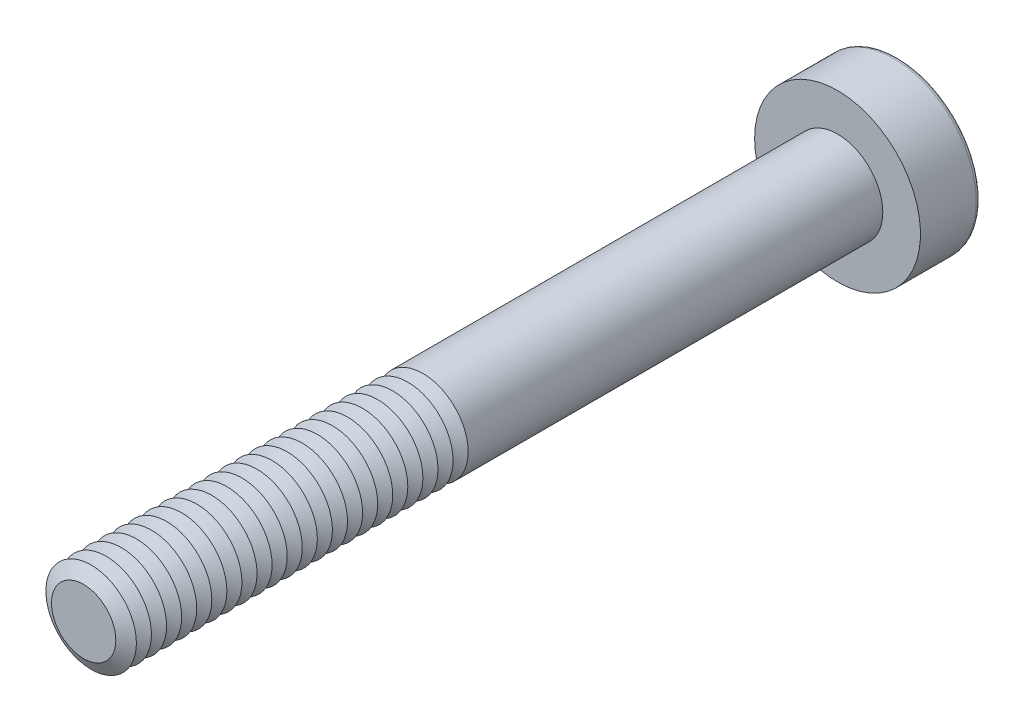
ISO-10303-21;
HEADER;
FILE_DESCRIPTION(('STEP AP214'),'2;1');
FILE_NAME('part.step','',(''),(''),'','','');
FILE_SCHEMA(('AUTOMOTIVE_DESIGN { 1 0 10303 214 1 1 1 1 }'));
ENDSEC;
DATA;
#1=APPLICATION_CONTEXT('core data for automotive mechanical design processes');
#2=APPLICATION_PROTOCOL_DEFINITION('international standard','automotive_design',2000,#1);
#3=PRODUCT_CONTEXT('',#1,'mechanical');
#4=PRODUCT('Part','Part','',(#3));
#5=PRODUCT_RELATED_PRODUCT_CATEGORY('part','',(#4));
#6=PRODUCT_DEFINITION_FORMATION('','',#4);
#7=PRODUCT_DEFINITION_CONTEXT('part definition',#1,'design');
#8=PRODUCT_DEFINITION('design','',#6,#7);
#9=PRODUCT_DEFINITION_SHAPE('','',#8);
#10=(LENGTH_UNIT() NAMED_UNIT(*) SI_UNIT(.MILLI.,.METRE.));
#11=(NAMED_UNIT(*) PLANE_ANGLE_UNIT() SI_UNIT($,.RADIAN.));
#12=(NAMED_UNIT(*) SI_UNIT($,.STERADIAN.) SOLID_ANGLE_UNIT());
#13=UNCERTAINTY_MEASURE_WITH_UNIT(LENGTH_MEASURE(1.E-05),#10,'distance_accuracy_value','');
#14=(GEOMETRIC_REPRESENTATION_CONTEXT(3) GLOBAL_UNCERTAINTY_ASSIGNED_CONTEXT((#13)) GLOBAL_UNIT_ASSIGNED_CONTEXT((#10,
#11,#12)) REPRESENTATION_CONTEXT('',''));
#15=CARTESIAN_POINT('',(0.,0.,0.));
#16=DIRECTION('',(0.,0.,1.));
#17=DIRECTION('',(1.,0.,0.));
#18=AXIS2_PLACEMENT_3D('',#15,#16,#17);
#19=CARTESIAN_POINT('',(0.,0.,23.25));
#20=DIRECTION('',(0.,0.,1.));
#21=DIRECTION('',(1.,0.,0.));
#22=AXIS2_PLACEMENT_3D('',#19,#20,#21);
#23=CONICAL_SURFACE('',#22,1.5,1.0471975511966);
#24=CARTESIAN_POINT('',(0.,0.,23.));
#25=DIRECTION('',(0.,0.,1.));
#26=DIRECTION('',(1.,0.,0.));
#27=AXIS2_PLACEMENT_3D('',#24,#25,#26);
#28=CIRCLE('',#27,1.06698729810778);
#29=CARTESIAN_POINT('',(1.06698729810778,0.,23.));
#30=VERTEX_POINT('',#29);
#31=EDGE_CURVE('E313',#30,#30,#28,.T.);
#32=ORIENTED_EDGE('',*,*,#31,.T.);
#33=EDGE_LOOP('',(#32));
#34=FACE_BOUND('',#33,.T.);
#35=CARTESIAN_POINT('',(0.,0.,23.25));
#36=DIRECTION('',(0.,0.,1.));
#37=DIRECTION('',(1.,0.,0.));
#38=AXIS2_PLACEMENT_3D('',#35,#36,#37);
#39=CIRCLE('',#38,1.5);
#40=CARTESIAN_POINT('',(1.5,0.,23.25));
#41=VERTEX_POINT('',#40);
#42=EDGE_CURVE('E316',#41,#41,#39,.T.);
#43=ORIENTED_EDGE('',*,*,#42,.F.);
#44=EDGE_LOOP('',(#43));
#45=FACE_BOUND('',#44,.T.);
#46=ADVANCED_FACE('F39',(#34,#45),#23,.T.);
#47=CARTESIAN_POINT('',(0.,0.,23.));
#48=DIRECTION('',(0.,0.,-1.));
#49=DIRECTION('',(-1.,0.,0.));
#50=AXIS2_PLACEMENT_3D('',#47,#48,#49);
#51=CONICAL_SURFACE('',#50,1.06698729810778,1.0471975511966);
#52=CARTESIAN_POINT('',(0.,0.,22.75));
#53=DIRECTION('',(0.,0.,1.));
#54=DIRECTION('',(1.,0.,0.));
#55=AXIS2_PLACEMENT_3D('',#52,#53,#54);
#56=CIRCLE('',#55,1.5);
#57=CARTESIAN_POINT('',(1.5,0.,22.75));
#58=VERTEX_POINT('',#57);
#59=EDGE_CURVE('E324',#58,#58,#56,.T.);
#60=ORIENTED_EDGE('',*,*,#59,.T.);
#61=EDGE_LOOP('',(#60));
#62=FACE_BOUND('',#61,.T.);
#63=ORIENTED_EDGE('',*,*,#31,.F.);
#64=EDGE_LOOP('',(#63));
#65=FACE_BOUND('',#64,.T.);
#66=ADVANCED_FACE('F244',(#62,#65),#51,.T.);
#67=CARTESIAN_POINT('',(0.,0.,25.));
#68=DIRECTION('',(0.,0.,1.));
#69=DIRECTION('',(1.,0.,0.));
#70=AXIS2_PLACEMENT_3D('',#67,#68,#69);
#71=PLANE('',#70);
#72=CARTESIAN_POINT('',(0.,0.,25.));
#73=DIRECTION('',(0.,0.,1.));
#74=DIRECTION('',(1.,0.,0.));
#75=AXIS2_PLACEMENT_3D('',#72,#73,#74);
#76=CIRCLE('',#75,1.06698729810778);
#77=CARTESIAN_POINT('',(1.06698729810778,0.,25.));
#78=VERTEX_POINT('',#77);
#79=EDGE_CURVE('E173',#78,#78,#76,.T.);
#80=ORIENTED_EDGE('',*,*,#79,.T.);
#81=EDGE_LOOP('',(#80));
#82=FACE_BOUND('',#81,.T.);
#83=ADVANCED_FACE('F250',(#82),#71,.T.);
#84=CARTESIAN_POINT('',(0.,0.,25.));
#85=DIRECTION('',(0.,0.,-1.));
#86=DIRECTION('',(-1.,0.,0.));
#87=AXIS2_PLACEMENT_3D('',#84,#85,#86);
#88=CONICAL_SURFACE('',#87,1.06698729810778,1.0471975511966);
#89=CARTESIAN_POINT('',(0.,0.,24.75));
#90=DIRECTION('',(0.,0.,1.));
#91=DIRECTION('',(1.,0.,0.));
#92=AXIS2_PLACEMENT_3D('',#89,#90,#91);
#93=CIRCLE('',#92,1.5);
#94=CARTESIAN_POINT('',(1.5,0.,24.75));
#95=VERTEX_POINT('',#94);
#96=EDGE_CURVE('E290',#95,#95,#93,.T.);
#97=ORIENTED_EDGE('',*,*,#96,.T.);
#98=EDGE_LOOP('',(#97));
#99=FACE_BOUND('',#98,.T.);
#100=ORIENTED_EDGE('',*,*,#79,.F.);
#101=EDGE_LOOP('',(#100));
#102=FACE_BOUND('',#101,.T.);
#103=ADVANCED_FACE('F198',(#99,#102),#88,.T.);
#104=CARTESIAN_POINT('',(0.,0.,24.75));
#105=DIRECTION('',(0.,0.,1.));
#106=DIRECTION('',(1.,0.,0.));
#107=AXIS2_PLACEMENT_3D('',#104,#105,#106);
#108=CONICAL_SURFACE('',#107,1.5,1.0471975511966);
#109=CARTESIAN_POINT('',(0.,0.,24.5));
#110=DIRECTION('',(0.,0.,1.));
#111=DIRECTION('',(1.,0.,0.));
#112=AXIS2_PLACEMENT_3D('',#109,#110,#111);
#113=CIRCLE('',#112,1.06698729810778);
#114=CARTESIAN_POINT('',(1.06698729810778,0.,24.5));
#115=VERTEX_POINT('',#114);
#116=EDGE_CURVE('E287',#115,#115,#113,.T.);
#117=ORIENTED_EDGE('',*,*,#116,.T.);
#118=EDGE_LOOP('',(#117));
#119=FACE_BOUND('',#118,.T.);
#120=ORIENTED_EDGE('',*,*,#96,.F.);
#121=EDGE_LOOP('',(#120));
#122=FACE_BOUND('',#121,.T.);
#123=ADVANCED_FACE('F276',(#119,#122),#108,.T.);
#124=CARTESIAN_POINT('',(0.,0.,24.5));
#125=DIRECTION('',(0.,0.,-1.));
#126=DIRECTION('',(-1.,0.,0.));
#127=AXIS2_PLACEMENT_3D('',#124,#125,#126);
#128=CONICAL_SURFACE('',#127,1.06698729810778,1.0471975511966);
#129=CARTESIAN_POINT('',(0.,0.,24.25));
#130=DIRECTION('',(0.,0.,1.));
#131=DIRECTION('',(1.,0.,0.));
#132=AXIS2_PLACEMENT_3D('',#129,#130,#131);
#133=CIRCLE('',#132,1.5);
#134=CARTESIAN_POINT('',(1.5,0.,24.25));
#135=VERTEX_POINT('',#134);
#136=EDGE_CURVE('E299',#135,#135,#133,.T.);
#137=ORIENTED_EDGE('',*,*,#136,.T.);
#138=EDGE_LOOP('',(#137));
#139=FACE_BOUND('',#138,.T.);
#140=ORIENTED_EDGE('',*,*,#116,.F.);
#141=EDGE_LOOP('',(#140));
#142=FACE_BOUND('',#141,.T.);
#143=ADVANCED_FACE('F273',(#139,#142),#128,.T.);
#144=CARTESIAN_POINT('',(0.,0.,24.25));
#145=DIRECTION('',(0.,0.,1.));
#146=DIRECTION('',(1.,0.,0.));
#147=AXIS2_PLACEMENT_3D('',#144,#145,#146);
#148=CONICAL_SURFACE('',#147,1.5,1.0471975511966);
#149=CARTESIAN_POINT('',(0.,0.,24.));
#150=DIRECTION('',(0.,0.,1.));
#151=DIRECTION('',(1.,0.,0.));
#152=AXIS2_PLACEMENT_3D('',#149,#150,#151);
#153=CIRCLE('',#152,1.06698729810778);
#154=CARTESIAN_POINT('',(1.06698729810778,0.,24.));
#155=VERTEX_POINT('',#154);
#156=EDGE_CURVE('E292',#155,#155,#153,.T.);
#157=ORIENTED_EDGE('',*,*,#156,.T.);
#158=EDGE_LOOP('',(#157));
#159=FACE_BOUND('',#158,.T.);
#160=ORIENTED_EDGE('',*,*,#136,.F.);
#161=EDGE_LOOP('',(#160));
#162=FACE_BOUND('',#161,.T.);
#163=ADVANCED_FACE('F269',(#159,#162),#148,.T.);
#164=CARTESIAN_POINT('',(0.,0.,24.));
#165=DIRECTION('',(0.,0.,-1.));
#166=DIRECTION('',(-1.,0.,0.));
#167=AXIS2_PLACEMENT_3D('',#164,#165,#166);
#168=CONICAL_SURFACE('',#167,1.06698729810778,1.0471975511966);
#169=CARTESIAN_POINT('',(0.,0.,23.75));
#170=DIRECTION('',(0.,0.,1.));
#171=DIRECTION('',(1.,0.,0.));
#172=AXIS2_PLACEMENT_3D('',#169,#170,#171);
#173=CIRCLE('',#172,1.5);
#174=CARTESIAN_POINT('',(1.5,0.,23.75));
#175=VERTEX_POINT('',#174);
#176=EDGE_CURVE('E309',#175,#175,#173,.T.);
#177=ORIENTED_EDGE('',*,*,#176,.T.);
#178=EDGE_LOOP('',(#177));
#179=FACE_BOUND('',#178,.T.);
#180=ORIENTED_EDGE('',*,*,#156,.F.);
#181=EDGE_LOOP('',(#180));
#182=FACE_BOUND('',#181,.T.);
#183=ADVANCED_FACE('F265',(#179,#182),#168,.T.);
#184=CARTESIAN_POINT('',(0.,0.,23.75));
#185=DIRECTION('',(0.,0.,1.));
#186=DIRECTION('',(1.,0.,0.));
#187=AXIS2_PLACEMENT_3D('',#184,#185,#186);
#188=CONICAL_SURFACE('',#187,1.5,1.0471975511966);
#189=CARTESIAN_POINT('',(0.,0.,23.5));
#190=DIRECTION('',(0.,0.,1.));
#191=DIRECTION('',(1.,0.,0.));
#192=AXIS2_PLACEMENT_3D('',#189,#190,#191);
#193=CIRCLE('',#192,1.06698729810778);
#194=CARTESIAN_POINT('',(1.06698729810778,0.,23.5));
#195=VERTEX_POINT('',#194);
#196=EDGE_CURVE('E305',#195,#195,#193,.T.);
#197=ORIENTED_EDGE('',*,*,#196,.T.);
#198=EDGE_LOOP('',(#197));
#199=FACE_BOUND('',#198,.T.);
#200=ORIENTED_EDGE('',*,*,#176,.F.);
#201=EDGE_LOOP('',(#200));
#202=FACE_BOUND('',#201,.T.);
#203=ADVANCED_FACE('F261',(#199,#202),#188,.T.);
#204=CARTESIAN_POINT('',(0.,0.,23.5));
#205=DIRECTION('',(0.,0.,-1.));
#206=DIRECTION('',(-1.,0.,0.));
#207=AXIS2_PLACEMENT_3D('',#204,#205,#206);
#208=CONICAL_SURFACE('',#207,1.06698729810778,1.0471975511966);
#209=ORIENTED_EDGE('',*,*,#42,.T.);
#210=EDGE_LOOP('',(#209));
#211=FACE_BOUND('',#210,.T.);
#212=ORIENTED_EDGE('',*,*,#196,.F.);
#213=EDGE_LOOP('',(#212));
#214=FACE_BOUND('',#213,.T.);
#215=ADVANCED_FACE('F257',(#211,#214),#208,.T.);
#216=CARTESIAN_POINT('',(0.,0.,22.75));
#217=DIRECTION('',(0.,0.,1.));
#218=DIRECTION('',(1.,0.,0.));
#219=AXIS2_PLACEMENT_3D('',#216,#217,#218);
#220=CONICAL_SURFACE('',#219,1.5,1.0471975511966);
#221=CARTESIAN_POINT('',(0.,0.,22.5));
#222=DIRECTION('',(0.,0.,1.));
#223=DIRECTION('',(1.,0.,0.));
#224=AXIS2_PLACEMENT_3D('',#221,#222,#223);
#225=CIRCLE('',#224,1.06698729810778);
#226=CARTESIAN_POINT('',(1.06698729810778,0.,22.5));
#227=VERTEX_POINT('',#226);
#228=EDGE_CURVE('E320',#227,#227,#225,.T.);
#229=ORIENTED_EDGE('',*,*,#228,.T.);
#230=EDGE_LOOP('',(#229));
#231=FACE_BOUND('',#230,.T.);
#232=ORIENTED_EDGE('',*,*,#59,.F.);
#233=EDGE_LOOP('',(#232));
#234=FACE_BOUND('',#233,.T.);
#235=ADVANCED_FACE('F260',(#231,#234),#220,.T.);
#236=CARTESIAN_POINT('',(0.,0.,22.5));
#237=DIRECTION('',(0.,0.,-1.));
#238=DIRECTION('',(-1.,0.,0.));
#239=AXIS2_PLACEMENT_3D('',#236,#237,#238);
#240=CONICAL_SURFACE('',#239,1.06698729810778,1.0471975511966);
#241=CARTESIAN_POINT('',(0.,0.,22.25));
#242=DIRECTION('',(0.,0.,1.));
#243=DIRECTION('',(1.,0.,0.));
#244=AXIS2_PLACEMENT_3D('',#241,#242,#243);
#245=CIRCLE('',#244,1.5);
#246=CARTESIAN_POINT('',(1.5,0.,22.25));
#247=VERTEX_POINT('',#246);
#248=EDGE_CURVE('E332',#247,#247,#245,.T.);
#249=ORIENTED_EDGE('',*,*,#248,.T.);
#250=EDGE_LOOP('',(#249));
#251=FACE_BOUND('',#250,.T.);
#252=ORIENTED_EDGE('',*,*,#228,.F.);
#253=EDGE_LOOP('',(#252));
#254=FACE_BOUND('',#253,.T.);
#255=ADVANCED_FACE('F606',(#251,#254),#240,.T.);
#256=CARTESIAN_POINT('',(0.,0.,22.25));
#257=DIRECTION('',(0.,0.,1.));
#258=DIRECTION('',(1.,0.,0.));
#259=AXIS2_PLACEMENT_3D('',#256,#257,#258);
#260=CONICAL_SURFACE('',#259,1.5,1.0471975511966);
#261=CARTESIAN_POINT('',(0.,0.,22.));
#262=DIRECTION('',(0.,0.,1.));
#263=DIRECTION('',(1.,0.,0.));
#264=AXIS2_PLACEMENT_3D('',#261,#262,#263);
#265=CIRCLE('',#264,1.06698729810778);
#266=CARTESIAN_POINT('',(1.06698729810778,0.,22.));
#267=VERTEX_POINT('',#266);
#268=EDGE_CURVE('E328',#267,#267,#265,.T.);
#269=ORIENTED_EDGE('',*,*,#268,.T.);
#270=EDGE_LOOP('',(#269));
#271=FACE_BOUND('',#270,.T.);
#272=ORIENTED_EDGE('',*,*,#248,.F.);
#273=EDGE_LOOP('',(#272));
#274=FACE_BOUND('',#273,.T.);
#275=ADVANCED_FACE('F602',(#271,#274),#260,.T.);
#276=CARTESIAN_POINT('',(0.,0.,22.));
#277=DIRECTION('',(0.,0.,-1.));
#278=DIRECTION('',(-1.,0.,0.));
#279=AXIS2_PLACEMENT_3D('',#276,#277,#278);
#280=CONICAL_SURFACE('',#279,1.06698729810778,1.0471975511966);
#281=CARTESIAN_POINT('',(0.,0.,21.75));
#282=DIRECTION('',(0.,0.,1.));
#283=DIRECTION('',(1.,0.,0.));
#284=AXIS2_PLACEMENT_3D('',#281,#282,#283);
#285=CIRCLE('',#284,1.5);
#286=CARTESIAN_POINT('',(1.5,0.,21.75));
#287=VERTEX_POINT('',#286);
#288=EDGE_CURVE('E340',#287,#287,#285,.T.);
#289=ORIENTED_EDGE('',*,*,#288,.T.);
#290=EDGE_LOOP('',(#289));
#291=FACE_BOUND('',#290,.T.);
#292=ORIENTED_EDGE('',*,*,#268,.F.);
#293=EDGE_LOOP('',(#292));
#294=FACE_BOUND('',#293,.T.);
#295=ADVANCED_FACE('F598',(#291,#294),#280,.T.);
#296=CARTESIAN_POINT('',(0.,0.,21.75));
#297=DIRECTION('',(0.,0.,1.));
#298=DIRECTION('',(1.,0.,0.));
#299=AXIS2_PLACEMENT_3D('',#296,#297,#298);
#300=CONICAL_SURFACE('',#299,1.5,1.0471975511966);
#301=CARTESIAN_POINT('',(0.,0.,21.5));
#302=DIRECTION('',(0.,0.,1.));
#303=DIRECTION('',(1.,0.,0.));
#304=AXIS2_PLACEMENT_3D('',#301,#302,#303);
#305=CIRCLE('',#304,1.06698729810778);
#306=CARTESIAN_POINT('',(1.06698729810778,0.,21.5));
#307=VERTEX_POINT('',#306);
#308=EDGE_CURVE('E336',#307,#307,#305,.T.);
#309=ORIENTED_EDGE('',*,*,#308,.T.);
#310=EDGE_LOOP('',(#309));
#311=FACE_BOUND('',#310,.T.);
#312=ORIENTED_EDGE('',*,*,#288,.F.);
#313=EDGE_LOOP('',(#312));
#314=FACE_BOUND('',#313,.T.);
#315=ADVANCED_FACE('F594',(#311,#314),#300,.T.);
#316=CARTESIAN_POINT('',(0.,0.,21.5));
#317=DIRECTION('',(0.,0.,-1.));
#318=DIRECTION('',(-1.,0.,0.));
#319=AXIS2_PLACEMENT_3D('',#316,#317,#318);
#320=CONICAL_SURFACE('',#319,1.06698729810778,1.0471975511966);
#321=CARTESIAN_POINT('',(0.,0.,21.25));
#322=DIRECTION('',(0.,0.,1.));
#323=DIRECTION('',(1.,0.,0.));
#324=AXIS2_PLACEMENT_3D('',#321,#322,#323);
#325=CIRCLE('',#324,1.5);
#326=CARTESIAN_POINT('',(1.5,0.,21.25));
#327=VERTEX_POINT('',#326);
#328=EDGE_CURVE('E348',#327,#327,#325,.T.);
#329=ORIENTED_EDGE('',*,*,#328,.T.);
#330=EDGE_LOOP('',(#329));
#331=FACE_BOUND('',#330,.T.);
#332=ORIENTED_EDGE('',*,*,#308,.F.);
#333=EDGE_LOOP('',(#332));
#334=FACE_BOUND('',#333,.T.);
#335=ADVANCED_FACE('F590',(#331,#334),#320,.T.);
#336=CARTESIAN_POINT('',(0.,0.,21.25));
#337=DIRECTION('',(0.,0.,1.));
#338=DIRECTION('',(1.,0.,0.));
#339=AXIS2_PLACEMENT_3D('',#336,#337,#338);
#340=CONICAL_SURFACE('',#339,1.5,1.0471975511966);
#341=CARTESIAN_POINT('',(0.,0.,21.));
#342=DIRECTION('',(0.,0.,1.));
#343=DIRECTION('',(1.,0.,0.));
#344=AXIS2_PLACEMENT_3D('',#341,#342,#343);
#345=CIRCLE('',#344,1.06698729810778);
#346=CARTESIAN_POINT('',(1.06698729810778,0.,21.));
#347=VERTEX_POINT('',#346);
#348=EDGE_CURVE('E344',#347,#347,#345,.T.);
#349=ORIENTED_EDGE('',*,*,#348,.T.);
#350=EDGE_LOOP('',(#349));
#351=FACE_BOUND('',#350,.T.);
#352=ORIENTED_EDGE('',*,*,#328,.F.);
#353=EDGE_LOOP('',(#352));
#354=FACE_BOUND('',#353,.T.);
#355=ADVANCED_FACE('F586',(#351,#354),#340,.T.);
#356=CARTESIAN_POINT('',(0.,0.,21.));
#357=DIRECTION('',(0.,0.,-1.));
#358=DIRECTION('',(-1.,0.,0.));
#359=AXIS2_PLACEMENT_3D('',#356,#357,#358);
#360=CONICAL_SURFACE('',#359,1.06698729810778,1.0471975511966);
#361=CARTESIAN_POINT('',(0.,0.,20.75));
#362=DIRECTION('',(0.,0.,1.));
#363=DIRECTION('',(1.,0.,0.));
#364=AXIS2_PLACEMENT_3D('',#361,#362,#363);
#365=CIRCLE('',#364,1.5);
#366=CARTESIAN_POINT('',(1.5,0.,20.75));
#367=VERTEX_POINT('',#366);
#368=EDGE_CURVE('E356',#367,#367,#365,.T.);
#369=ORIENTED_EDGE('',*,*,#368,.T.);
#370=EDGE_LOOP('',(#369));
#371=FACE_BOUND('',#370,.T.);
#372=ORIENTED_EDGE('',*,*,#348,.F.);
#373=EDGE_LOOP('',(#372));
#374=FACE_BOUND('',#373,.T.);
#375=ADVANCED_FACE('F582',(#371,#374),#360,.T.);
#376=CARTESIAN_POINT('',(0.,0.,20.75));
#377=DIRECTION('',(0.,0.,1.));
#378=DIRECTION('',(1.,0.,0.));
#379=AXIS2_PLACEMENT_3D('',#376,#377,#378);
#380=CONICAL_SURFACE('',#379,1.5,1.0471975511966);
#381=CARTESIAN_POINT('',(0.,0.,20.5));
#382=DIRECTION('',(0.,0.,1.));
#383=DIRECTION('',(1.,0.,0.));
#384=AXIS2_PLACEMENT_3D('',#381,#382,#383);
#385=CIRCLE('',#384,1.06698729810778);
#386=CARTESIAN_POINT('',(1.06698729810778,0.,20.5));
#387=VERTEX_POINT('',#386);
#388=EDGE_CURVE('E352',#387,#387,#385,.T.);
#389=ORIENTED_EDGE('',*,*,#388,.T.);
#390=EDGE_LOOP('',(#389));
#391=FACE_BOUND('',#390,.T.);
#392=ORIENTED_EDGE('',*,*,#368,.F.);
#393=EDGE_LOOP('',(#392));
#394=FACE_BOUND('',#393,.T.);
#395=ADVANCED_FACE('F578',(#391,#394),#380,.T.);
#396=CARTESIAN_POINT('',(0.,0.,20.5));
#397=DIRECTION('',(0.,0.,-1.));
#398=DIRECTION('',(-1.,0.,0.));
#399=AXIS2_PLACEMENT_3D('',#396,#397,#398);
#400=CONICAL_SURFACE('',#399,1.06698729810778,1.0471975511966);
#401=CARTESIAN_POINT('',(0.,0.,20.25));
#402=DIRECTION('',(0.,0.,1.));
#403=DIRECTION('',(1.,0.,0.));
#404=AXIS2_PLACEMENT_3D('',#401,#402,#403);
#405=CIRCLE('',#404,1.5);
#406=CARTESIAN_POINT('',(1.5,0.,20.25));
#407=VERTEX_POINT('',#406);
#408=EDGE_CURVE('E363',#407,#407,#405,.T.);
#409=ORIENTED_EDGE('',*,*,#408,.T.);
#410=EDGE_LOOP('',(#409));
#411=FACE_BOUND('',#410,.T.);
#412=ORIENTED_EDGE('',*,*,#388,.F.);
#413=EDGE_LOOP('',(#412));
#414=FACE_BOUND('',#413,.T.);
#415=ADVANCED_FACE('F574',(#411,#414),#400,.T.);
#416=CARTESIAN_POINT('',(0.,0.,20.25));
#417=DIRECTION('',(0.,0.,1.));
#418=DIRECTION('',(1.,0.,0.));
#419=AXIS2_PLACEMENT_3D('',#416,#417,#418);
#420=CONICAL_SURFACE('',#419,1.5,1.0471975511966);
#421=CARTESIAN_POINT('',(0.,0.,20.));
#422=DIRECTION('',(0.,0.,1.));
#423=DIRECTION('',(1.,0.,0.));
#424=AXIS2_PLACEMENT_3D('',#421,#422,#423);
#425=CIRCLE('',#424,1.06698729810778);
#426=CARTESIAN_POINT('',(1.06698729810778,0.,20.));
#427=VERTEX_POINT('',#426);
#428=EDGE_CURVE('E360',#427,#427,#425,.T.);
#429=ORIENTED_EDGE('',*,*,#428,.T.);
#430=EDGE_LOOP('',(#429));
#431=FACE_BOUND('',#430,.T.);
#432=ORIENTED_EDGE('',*,*,#408,.F.);
#433=EDGE_LOOP('',(#432));
#434=FACE_BOUND('',#433,.T.);
#435=ADVANCED_FACE('F570',(#431,#434),#420,.T.);
#436=CARTESIAN_POINT('',(0.,0.,20.));
#437=DIRECTION('',(0.,0.,-1.));
#438=DIRECTION('',(-1.,0.,0.));
#439=AXIS2_PLACEMENT_3D('',#436,#437,#438);
#440=CONICAL_SURFACE('',#439,1.06698729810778,1.0471975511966);
#441=CARTESIAN_POINT('',(0.,0.,19.75));
#442=DIRECTION('',(0.,0.,1.));
#443=DIRECTION('',(1.,0.,0.));
#444=AXIS2_PLACEMENT_3D('',#441,#442,#443);
#445=CIRCLE('',#444,1.5);
#446=CARTESIAN_POINT('',(1.5,0.,19.75));
#447=VERTEX_POINT('',#446);
#448=EDGE_CURVE('E371',#447,#447,#445,.T.);
#449=ORIENTED_EDGE('',*,*,#448,.T.);
#450=EDGE_LOOP('',(#449));
#451=FACE_BOUND('',#450,.T.);
#452=ORIENTED_EDGE('',*,*,#428,.F.);
#453=EDGE_LOOP('',(#452));
#454=FACE_BOUND('',#453,.T.);
#455=ADVANCED_FACE('F566',(#451,#454),#440,.T.);
#456=CARTESIAN_POINT('',(0.,0.,19.75));
#457=DIRECTION('',(0.,0.,1.));
#458=DIRECTION('',(1.,0.,0.));
#459=AXIS2_PLACEMENT_3D('',#456,#457,#458);
#460=CONICAL_SURFACE('',#459,1.5,1.0471975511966);
#461=CARTESIAN_POINT('',(0.,0.,19.5));
#462=DIRECTION('',(0.,0.,1.));
#463=DIRECTION('',(1.,0.,0.));
#464=AXIS2_PLACEMENT_3D('',#461,#462,#463);
#465=CIRCLE('',#464,1.06698729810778);
#466=CARTESIAN_POINT('',(1.06698729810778,0.,19.5));
#467=VERTEX_POINT('',#466);
#468=EDGE_CURVE('E367',#467,#467,#465,.T.);
#469=ORIENTED_EDGE('',*,*,#468,.T.);
#470=EDGE_LOOP('',(#469));
#471=FACE_BOUND('',#470,.T.);
#472=ORIENTED_EDGE('',*,*,#448,.F.);
#473=EDGE_LOOP('',(#472));
#474=FACE_BOUND('',#473,.T.);
#475=ADVANCED_FACE('F562',(#471,#474),#460,.T.);
#476=CARTESIAN_POINT('',(0.,0.,19.5));
#477=DIRECTION('',(0.,0.,-1.));
#478=DIRECTION('',(-1.,0.,0.));
#479=AXIS2_PLACEMENT_3D('',#476,#477,#478);
#480=CONICAL_SURFACE('',#479,1.06698729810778,1.0471975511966);
#481=CARTESIAN_POINT('',(0.,0.,19.25));
#482=DIRECTION('',(0.,0.,1.));
#483=DIRECTION('',(1.,0.,0.));
#484=AXIS2_PLACEMENT_3D('',#481,#482,#483);
#485=CIRCLE('',#484,1.5);
#486=CARTESIAN_POINT('',(1.5,0.,19.25));
#487=VERTEX_POINT('',#486);
#488=EDGE_CURVE('E378',#487,#487,#485,.T.);
#489=ORIENTED_EDGE('',*,*,#488,.T.);
#490=EDGE_LOOP('',(#489));
#491=FACE_BOUND('',#490,.T.);
#492=ORIENTED_EDGE('',*,*,#468,.F.);
#493=EDGE_LOOP('',(#492));
#494=FACE_BOUND('',#493,.T.);
#495=ADVANCED_FACE('F558',(#491,#494),#480,.T.);
#496=CARTESIAN_POINT('',(0.,0.,19.25));
#497=DIRECTION('',(0.,0.,1.));
#498=DIRECTION('',(1.,0.,0.));
#499=AXIS2_PLACEMENT_3D('',#496,#497,#498);
#500=CONICAL_SURFACE('',#499,1.5,1.0471975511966);
#501=CARTESIAN_POINT('',(0.,0.,19.));
#502=DIRECTION('',(0.,0.,1.));
#503=DIRECTION('',(1.,0.,0.));
#504=AXIS2_PLACEMENT_3D('',#501,#502,#503);
#505=CIRCLE('',#504,1.06698729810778);
#506=CARTESIAN_POINT('',(1.06698729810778,0.,19.));
#507=VERTEX_POINT('',#506);
#508=EDGE_CURVE('E374',#507,#507,#505,.T.);
#509=ORIENTED_EDGE('',*,*,#508,.T.);
#510=EDGE_LOOP('',(#509));
#511=FACE_BOUND('',#510,.T.);
#512=ORIENTED_EDGE('',*,*,#488,.F.);
#513=EDGE_LOOP('',(#512));
#514=FACE_BOUND('',#513,.T.);
#515=ADVANCED_FACE('F554',(#511,#514),#500,.T.);
#516=CARTESIAN_POINT('',(0.,0.,19.));
#517=DIRECTION('',(0.,0.,-1.));
#518=DIRECTION('',(-1.,0.,0.));
#519=AXIS2_PLACEMENT_3D('',#516,#517,#518);
#520=CONICAL_SURFACE('',#519,1.06698729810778,1.0471975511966);
#521=CARTESIAN_POINT('',(0.,0.,18.75));
#522=DIRECTION('',(0.,0.,1.));
#523=DIRECTION('',(1.,0.,0.));
#524=AXIS2_PLACEMENT_3D('',#521,#522,#523);
#525=CIRCLE('',#524,1.5);
#526=CARTESIAN_POINT('',(1.5,0.,18.75));
#527=VERTEX_POINT('',#526);
#528=EDGE_CURVE('E386',#527,#527,#525,.T.);
#529=ORIENTED_EDGE('',*,*,#528,.T.);
#530=EDGE_LOOP('',(#529));
#531=FACE_BOUND('',#530,.T.);
#532=ORIENTED_EDGE('',*,*,#508,.F.);
#533=EDGE_LOOP('',(#532));
#534=FACE_BOUND('',#533,.T.);
#535=ADVANCED_FACE('F550',(#531,#534),#520,.T.);
#536=CARTESIAN_POINT('',(0.,0.,18.75));
#537=DIRECTION('',(0.,0.,1.));
#538=DIRECTION('',(1.,0.,0.));
#539=AXIS2_PLACEMENT_3D('',#536,#537,#538);
#540=CONICAL_SURFACE('',#539,1.5,1.0471975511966);
#541=CARTESIAN_POINT('',(0.,0.,18.5));
#542=DIRECTION('',(0.,0.,1.));
#543=DIRECTION('',(1.,0.,0.));
#544=AXIS2_PLACEMENT_3D('',#541,#542,#543);
#545=CIRCLE('',#544,1.06698729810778);
#546=CARTESIAN_POINT('',(1.06698729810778,0.,18.5));
#547=VERTEX_POINT('',#546);
#548=EDGE_CURVE('E382',#547,#547,#545,.T.);
#549=ORIENTED_EDGE('',*,*,#548,.T.);
#550=EDGE_LOOP('',(#549));
#551=FACE_BOUND('',#550,.T.);
#552=ORIENTED_EDGE('',*,*,#528,.F.);
#553=EDGE_LOOP('',(#552));
#554=FACE_BOUND('',#553,.T.);
#555=ADVANCED_FACE('F546',(#551,#554),#540,.T.);
#556=CARTESIAN_POINT('',(0.,0.,18.5));
#557=DIRECTION('',(0.,0.,-1.));
#558=DIRECTION('',(-1.,0.,0.));
#559=AXIS2_PLACEMENT_3D('',#556,#557,#558);
#560=CONICAL_SURFACE('',#559,1.06698729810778,1.0471975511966);
#561=CARTESIAN_POINT('',(0.,0.,18.25));
#562=DIRECTION('',(0.,0.,1.));
#563=DIRECTION('',(1.,0.,0.));
#564=AXIS2_PLACEMENT_3D('',#561,#562,#563);
#565=CIRCLE('',#564,1.5);
#566=CARTESIAN_POINT('',(1.5,0.,18.25));
#567=VERTEX_POINT('',#566);
#568=EDGE_CURVE('E394',#567,#567,#565,.T.);
#569=ORIENTED_EDGE('',*,*,#568,.T.);
#570=EDGE_LOOP('',(#569));
#571=FACE_BOUND('',#570,.T.);
#572=ORIENTED_EDGE('',*,*,#548,.F.);
#573=EDGE_LOOP('',(#572));
#574=FACE_BOUND('',#573,.T.);
#575=ADVANCED_FACE('F542',(#571,#574),#560,.T.);
#576=CARTESIAN_POINT('',(0.,0.,18.25));
#577=DIRECTION('',(0.,0.,1.));
#578=DIRECTION('',(1.,0.,0.));
#579=AXIS2_PLACEMENT_3D('',#576,#577,#578);
#580=CONICAL_SURFACE('',#579,1.5,1.0471975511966);
#581=CARTESIAN_POINT('',(0.,0.,18.));
#582=DIRECTION('',(0.,0.,1.));
#583=DIRECTION('',(1.,0.,0.));
#584=AXIS2_PLACEMENT_3D('',#581,#582,#583);
#585=CIRCLE('',#584,1.06698729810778);
#586=CARTESIAN_POINT('',(1.06698729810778,0.,18.));
#587=VERTEX_POINT('',#586);
#588=EDGE_CURVE('E390',#587,#587,#585,.T.);
#589=ORIENTED_EDGE('',*,*,#588,.T.);
#590=EDGE_LOOP('',(#589));
#591=FACE_BOUND('',#590,.T.);
#592=ORIENTED_EDGE('',*,*,#568,.F.);
#593=EDGE_LOOP('',(#592));
#594=FACE_BOUND('',#593,.T.);
#595=ADVANCED_FACE('F538',(#591,#594),#580,.T.);
#596=CARTESIAN_POINT('',(0.,0.,18.));
#597=DIRECTION('',(0.,0.,-1.));
#598=DIRECTION('',(-1.,0.,0.));
#599=AXIS2_PLACEMENT_3D('',#596,#597,#598);
#600=CONICAL_SURFACE('',#599,1.06698729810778,1.0471975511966);
#601=CARTESIAN_POINT('',(0.,0.,17.75));
#602=DIRECTION('',(0.,0.,1.));
#603=DIRECTION('',(1.,0.,0.));
#604=AXIS2_PLACEMENT_3D('',#601,#602,#603);
#605=CIRCLE('',#604,1.5);
#606=CARTESIAN_POINT('',(1.5,0.,17.75));
#607=VERTEX_POINT('',#606);
#608=EDGE_CURVE('E402',#607,#607,#605,.T.);
#609=ORIENTED_EDGE('',*,*,#608,.T.);
#610=EDGE_LOOP('',(#609));
#611=FACE_BOUND('',#610,.T.);
#612=ORIENTED_EDGE('',*,*,#588,.F.);
#613=EDGE_LOOP('',(#612));
#614=FACE_BOUND('',#613,.T.);
#615=ADVANCED_FACE('F534',(#611,#614),#600,.T.);
#616=CARTESIAN_POINT('',(0.,0.,17.75));
#617=DIRECTION('',(0.,0.,1.));
#618=DIRECTION('',(1.,0.,0.));
#619=AXIS2_PLACEMENT_3D('',#616,#617,#618);
#620=CONICAL_SURFACE('',#619,1.5,1.0471975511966);
#621=CARTESIAN_POINT('',(0.,0.,17.5));
#622=DIRECTION('',(0.,0.,1.));
#623=DIRECTION('',(1.,0.,0.));
#624=AXIS2_PLACEMENT_3D('',#621,#622,#623);
#625=CIRCLE('',#624,1.06698729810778);
#626=CARTESIAN_POINT('',(1.06698729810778,0.,17.5));
#627=VERTEX_POINT('',#626);
#628=EDGE_CURVE('E398',#627,#627,#625,.T.);
#629=ORIENTED_EDGE('',*,*,#628,.T.);
#630=EDGE_LOOP('',(#629));
#631=FACE_BOUND('',#630,.T.);
#632=ORIENTED_EDGE('',*,*,#608,.F.);
#633=EDGE_LOOP('',(#632));
#634=FACE_BOUND('',#633,.T.);
#635=ADVANCED_FACE('F530',(#631,#634),#620,.T.);
#636=CARTESIAN_POINT('',(0.,0.,17.5));
#637=DIRECTION('',(0.,0.,-1.));
#638=DIRECTION('',(-1.,0.,0.));
#639=AXIS2_PLACEMENT_3D('',#636,#637,#638);
#640=CONICAL_SURFACE('',#639,1.06698729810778,1.0471975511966);
#641=CARTESIAN_POINT('',(0.,0.,17.25));
#642=DIRECTION('',(0.,0.,1.));
#643=DIRECTION('',(1.,0.,0.));
#644=AXIS2_PLACEMENT_3D('',#641,#642,#643);
#645=CIRCLE('',#644,1.5);
#646=CARTESIAN_POINT('',(1.5,0.,17.25));
#647=VERTEX_POINT('',#646);
#648=EDGE_CURVE('E410',#647,#647,#645,.T.);
#649=ORIENTED_EDGE('',*,*,#648,.T.);
#650=EDGE_LOOP('',(#649));
#651=FACE_BOUND('',#650,.T.);
#652=ORIENTED_EDGE('',*,*,#628,.F.);
#653=EDGE_LOOP('',(#652));
#654=FACE_BOUND('',#653,.T.);
#655=ADVANCED_FACE('F526',(#651,#654),#640,.T.);
#656=CARTESIAN_POINT('',(0.,0.,17.25));
#657=DIRECTION('',(0.,0.,1.));
#658=DIRECTION('',(1.,0.,0.));
#659=AXIS2_PLACEMENT_3D('',#656,#657,#658);
#660=CONICAL_SURFACE('',#659,1.5,1.0471975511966);
#661=CARTESIAN_POINT('',(0.,0.,17.));
#662=DIRECTION('',(0.,0.,1.));
#663=DIRECTION('',(1.,0.,0.));
#664=AXIS2_PLACEMENT_3D('',#661,#662,#663);
#665=CIRCLE('',#664,1.06698729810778);
#666=CARTESIAN_POINT('',(1.06698729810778,0.,17.));
#667=VERTEX_POINT('',#666);
#668=EDGE_CURVE('E406',#667,#667,#665,.T.);
#669=ORIENTED_EDGE('',*,*,#668,.T.);
#670=EDGE_LOOP('',(#669));
#671=FACE_BOUND('',#670,.T.);
#672=ORIENTED_EDGE('',*,*,#648,.F.);
#673=EDGE_LOOP('',(#672));
#674=FACE_BOUND('',#673,.T.);
#675=ADVANCED_FACE('F522',(#671,#674),#660,.T.);
#676=CARTESIAN_POINT('',(0.,0.,17.));
#677=DIRECTION('',(0.,0.,-1.));
#678=DIRECTION('',(-1.,0.,0.));
#679=AXIS2_PLACEMENT_3D('',#676,#677,#678);
#680=CONICAL_SURFACE('',#679,1.06698729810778,1.0471975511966);
#681=CARTESIAN_POINT('',(0.,0.,16.75));
#682=DIRECTION('',(0.,0.,1.));
#683=DIRECTION('',(1.,0.,0.));
#684=AXIS2_PLACEMENT_3D('',#681,#682,#683);
#685=CIRCLE('',#684,1.5);
#686=CARTESIAN_POINT('',(1.5,0.,16.75));
#687=VERTEX_POINT('',#686);
#688=EDGE_CURVE('E418',#687,#687,#685,.T.);
#689=ORIENTED_EDGE('',*,*,#688,.T.);
#690=EDGE_LOOP('',(#689));
#691=FACE_BOUND('',#690,.T.);
#692=ORIENTED_EDGE('',*,*,#668,.F.);
#693=EDGE_LOOP('',(#692));
#694=FACE_BOUND('',#693,.T.);
#695=ADVANCED_FACE('F518',(#691,#694),#680,.T.);
#696=CARTESIAN_POINT('',(0.,0.,16.75));
#697=DIRECTION('',(0.,0.,1.));
#698=DIRECTION('',(1.,0.,0.));
#699=AXIS2_PLACEMENT_3D('',#696,#697,#698);
#700=CONICAL_SURFACE('',#699,1.5,1.0471975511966);
#701=CARTESIAN_POINT('',(0.,0.,16.5));
#702=DIRECTION('',(0.,0.,1.));
#703=DIRECTION('',(1.,0.,0.));
#704=AXIS2_PLACEMENT_3D('',#701,#702,#703);
#705=CIRCLE('',#704,1.06698729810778);
#706=CARTESIAN_POINT('',(1.06698729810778,0.,16.5));
#707=VERTEX_POINT('',#706);
#708=EDGE_CURVE('E414',#707,#707,#705,.T.);
#709=ORIENTED_EDGE('',*,*,#708,.T.);
#710=EDGE_LOOP('',(#709));
#711=FACE_BOUND('',#710,.T.);
#712=ORIENTED_EDGE('',*,*,#688,.F.);
#713=EDGE_LOOP('',(#712));
#714=FACE_BOUND('',#713,.T.);
#715=ADVANCED_FACE('F514',(#711,#714),#700,.T.);
#716=CARTESIAN_POINT('',(0.,0.,16.5));
#717=DIRECTION('',(0.,0.,-1.));
#718=DIRECTION('',(-1.,0.,0.));
#719=AXIS2_PLACEMENT_3D('',#716,#717,#718);
#720=CONICAL_SURFACE('',#719,1.06698729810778,1.0471975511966);
#721=CARTESIAN_POINT('',(0.,0.,16.25));
#722=DIRECTION('',(0.,0.,1.));
#723=DIRECTION('',(1.,0.,0.));
#724=AXIS2_PLACEMENT_3D('',#721,#722,#723);
#725=CIRCLE('',#724,1.5);
#726=CARTESIAN_POINT('',(1.5,0.,16.25));
#727=VERTEX_POINT('',#726);
#728=EDGE_CURVE('E426',#727,#727,#725,.T.);
#729=ORIENTED_EDGE('',*,*,#728,.T.);
#730=EDGE_LOOP('',(#729));
#731=FACE_BOUND('',#730,.T.);
#732=ORIENTED_EDGE('',*,*,#708,.F.);
#733=EDGE_LOOP('',(#732));
#734=FACE_BOUND('',#733,.T.);
#735=ADVANCED_FACE('F510',(#731,#734),#720,.T.);
#736=CARTESIAN_POINT('',(0.,0.,16.25));
#737=DIRECTION('',(0.,0.,1.));
#738=DIRECTION('',(1.,0.,0.));
#739=AXIS2_PLACEMENT_3D('',#736,#737,#738);
#740=CONICAL_SURFACE('',#739,1.5,1.0471975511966);
#741=CARTESIAN_POINT('',(0.,0.,16.));
#742=DIRECTION('',(0.,0.,1.));
#743=DIRECTION('',(1.,0.,0.));
#744=AXIS2_PLACEMENT_3D('',#741,#742,#743);
#745=CIRCLE('',#744,1.06698729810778);
#746=CARTESIAN_POINT('',(1.06698729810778,0.,16.));
#747=VERTEX_POINT('',#746);
#748=EDGE_CURVE('E422',#747,#747,#745,.T.);
#749=ORIENTED_EDGE('',*,*,#748,.T.);
#750=EDGE_LOOP('',(#749));
#751=FACE_BOUND('',#750,.T.);
#752=ORIENTED_EDGE('',*,*,#728,.F.);
#753=EDGE_LOOP('',(#752));
#754=FACE_BOUND('',#753,.T.);
#755=ADVANCED_FACE('F506',(#751,#754),#740,.T.);
#756=CARTESIAN_POINT('',(0.,0.,16.));
#757=DIRECTION('',(0.,0.,-1.));
#758=DIRECTION('',(-1.,0.,0.));
#759=AXIS2_PLACEMENT_3D('',#756,#757,#758);
#760=CONICAL_SURFACE('',#759,1.06698729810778,1.0471975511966);
#761=CARTESIAN_POINT('',(0.,0.,15.75));
#762=DIRECTION('',(0.,0.,1.));
#763=DIRECTION('',(1.,0.,0.));
#764=AXIS2_PLACEMENT_3D('',#761,#762,#763);
#765=CIRCLE('',#764,1.5);
#766=CARTESIAN_POINT('',(1.5,0.,15.75));
#767=VERTEX_POINT('',#766);
#768=EDGE_CURVE('E434',#767,#767,#765,.T.);
#769=ORIENTED_EDGE('',*,*,#768,.T.);
#770=EDGE_LOOP('',(#769));
#771=FACE_BOUND('',#770,.T.);
#772=ORIENTED_EDGE('',*,*,#748,.F.);
#773=EDGE_LOOP('',(#772));
#774=FACE_BOUND('',#773,.T.);
#775=ADVANCED_FACE('F502',(#771,#774),#760,.T.);
#776=CARTESIAN_POINT('',(0.,0.,15.75));
#777=DIRECTION('',(0.,0.,1.));
#778=DIRECTION('',(1.,0.,0.));
#779=AXIS2_PLACEMENT_3D('',#776,#777,#778);
#780=CONICAL_SURFACE('',#779,1.5,1.0471975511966);
#781=CARTESIAN_POINT('',(0.,0.,15.5));
#782=DIRECTION('',(0.,0.,1.));
#783=DIRECTION('',(1.,0.,0.));
#784=AXIS2_PLACEMENT_3D('',#781,#782,#783);
#785=CIRCLE('',#784,1.06698729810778);
#786=CARTESIAN_POINT('',(1.06698729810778,0.,15.5));
#787=VERTEX_POINT('',#786);
#788=EDGE_CURVE('E430',#787,#787,#785,.T.);
#789=ORIENTED_EDGE('',*,*,#788,.T.);
#790=EDGE_LOOP('',(#789));
#791=FACE_BOUND('',#790,.T.);
#792=ORIENTED_EDGE('',*,*,#768,.F.);
#793=EDGE_LOOP('',(#792));
#794=FACE_BOUND('',#793,.T.);
#795=ADVANCED_FACE('F498',(#791,#794),#780,.T.);
#796=CARTESIAN_POINT('',(0.,0.,15.5));
#797=DIRECTION('',(0.,0.,-1.));
#798=DIRECTION('',(-1.,0.,0.));
#799=AXIS2_PLACEMENT_3D('',#796,#797,#798);
#800=CONICAL_SURFACE('',#799,1.06698729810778,1.0471975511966);
#801=CARTESIAN_POINT('',(0.,0.,15.25));
#802=DIRECTION('',(0.,0.,1.));
#803=DIRECTION('',(1.,0.,0.));
#804=AXIS2_PLACEMENT_3D('',#801,#802,#803);
#805=CIRCLE('',#804,1.5);
#806=CARTESIAN_POINT('',(1.5,0.,15.25));
#807=VERTEX_POINT('',#806);
#808=EDGE_CURVE('E442',#807,#807,#805,.T.);
#809=ORIENTED_EDGE('',*,*,#808,.T.);
#810=EDGE_LOOP('',(#809));
#811=FACE_BOUND('',#810,.T.);
#812=ORIENTED_EDGE('',*,*,#788,.F.);
#813=EDGE_LOOP('',(#812));
#814=FACE_BOUND('',#813,.T.);
#815=ADVANCED_FACE('F494',(#811,#814),#800,.T.);
#816=CARTESIAN_POINT('',(0.,0.,15.25));
#817=DIRECTION('',(0.,0.,1.));
#818=DIRECTION('',(1.,0.,0.));
#819=AXIS2_PLACEMENT_3D('',#816,#817,#818);
#820=CONICAL_SURFACE('',#819,1.5,1.0471975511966);
#821=CARTESIAN_POINT('',(0.,0.,15.));
#822=DIRECTION('',(0.,0.,1.));
#823=DIRECTION('',(1.,0.,0.));
#824=AXIS2_PLACEMENT_3D('',#821,#822,#823);
#825=CIRCLE('',#824,1.06698729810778);
#826=CARTESIAN_POINT('',(1.06698729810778,0.,15.));
#827=VERTEX_POINT('',#826);
#828=EDGE_CURVE('E438',#827,#827,#825,.T.);
#829=ORIENTED_EDGE('',*,*,#828,.T.);
#830=EDGE_LOOP('',(#829));
#831=FACE_BOUND('',#830,.T.);
#832=ORIENTED_EDGE('',*,*,#808,.F.);
#833=EDGE_LOOP('',(#832));
#834=FACE_BOUND('',#833,.T.);
#835=ADVANCED_FACE('F490',(#831,#834),#820,.T.);
#836=CARTESIAN_POINT('',(0.,0.,15.));
#837=DIRECTION('',(0.,0.,-1.));
#838=DIRECTION('',(-1.,0.,0.));
#839=AXIS2_PLACEMENT_3D('',#836,#837,#838);
#840=CONICAL_SURFACE('',#839,1.06698729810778,1.0471975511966);
#841=CARTESIAN_POINT('',(0.,0.,14.75));
#842=DIRECTION('',(0.,0.,1.));
#843=DIRECTION('',(1.,0.,0.));
#844=AXIS2_PLACEMENT_3D('',#841,#842,#843);
#845=CIRCLE('',#844,1.5);
#846=CARTESIAN_POINT('',(1.5,0.,14.75));
#847=VERTEX_POINT('',#846);
#848=EDGE_CURVE('E450',#847,#847,#845,.T.);
#849=ORIENTED_EDGE('',*,*,#848,.T.);
#850=EDGE_LOOP('',(#849));
#851=FACE_BOUND('',#850,.T.);
#852=ORIENTED_EDGE('',*,*,#828,.F.);
#853=EDGE_LOOP('',(#852));
#854=FACE_BOUND('',#853,.T.);
#855=ADVANCED_FACE('F486',(#851,#854),#840,.T.);
#856=CARTESIAN_POINT('',(0.,0.,14.75));
#857=DIRECTION('',(0.,0.,1.));
#858=DIRECTION('',(1.,0.,0.));
#859=AXIS2_PLACEMENT_3D('',#856,#857,#858);
#860=CONICAL_SURFACE('',#859,1.5,1.0471975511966);
#861=CARTESIAN_POINT('',(0.,0.,14.5));
#862=DIRECTION('',(0.,0.,1.));
#863=DIRECTION('',(1.,0.,0.));
#864=AXIS2_PLACEMENT_3D('',#861,#862,#863);
#865=CIRCLE('',#864,1.06698729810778);
#866=CARTESIAN_POINT('',(1.06698729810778,0.,14.5));
#867=VERTEX_POINT('',#866);
#868=EDGE_CURVE('E446',#867,#867,#865,.T.);
#869=ORIENTED_EDGE('',*,*,#868,.T.);
#870=EDGE_LOOP('',(#869));
#871=FACE_BOUND('',#870,.T.);
#872=ORIENTED_EDGE('',*,*,#848,.F.);
#873=EDGE_LOOP('',(#872));
#874=FACE_BOUND('',#873,.T.);
#875=ADVANCED_FACE('F481',(#871,#874),#860,.T.);
#876=CARTESIAN_POINT('',(0.,0.,14.5));
#877=DIRECTION('',(0.,0.,-1.));
#878=DIRECTION('',(-1.,0.,0.));
#879=AXIS2_PLACEMENT_3D('',#876,#877,#878);
#880=CONICAL_SURFACE('',#879,1.06698729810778,1.0471975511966);
#881=CARTESIAN_POINT('',(0.,0.,14.25));
#882=DIRECTION('',(0.,0.,1.));
#883=DIRECTION('',(1.,0.,0.));
#884=AXIS2_PLACEMENT_3D('',#881,#882,#883);
#885=CIRCLE('',#884,1.5);
#886=CARTESIAN_POINT('',(1.5,0.,14.25));
#887=VERTEX_POINT('',#886);
#888=EDGE_CURVE('E462',#887,#887,#885,.T.);
#889=ORIENTED_EDGE('',*,*,#888,.T.);
#890=EDGE_LOOP('',(#889));
#891=FACE_BOUND('',#890,.T.);
#892=ORIENTED_EDGE('',*,*,#868,.F.);
#893=EDGE_LOOP('',(#892));
#894=FACE_BOUND('',#893,.T.);
#895=ADVANCED_FACE('F467',(#891,#894),#880,.T.);
#896=CARTESIAN_POINT('',(0.,0.,14.25));
#897=DIRECTION('',(0.,0.,1.));
#898=DIRECTION('',(1.,0.,0.));
#899=AXIS2_PLACEMENT_3D('',#896,#897,#898);
#900=CONICAL_SURFACE('',#899,1.5,1.0471975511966);
#901=CARTESIAN_POINT('',(0.,0.,14.));
#902=DIRECTION('',(0.,0.,1.));
#903=DIRECTION('',(1.,0.,0.));
#904=AXIS2_PLACEMENT_3D('',#901,#902,#903);
#905=CIRCLE('',#904,1.06698729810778);
#906=CARTESIAN_POINT('',(1.06698729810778,0.,14.));
#907=VERTEX_POINT('',#906);
#908=EDGE_CURVE('E454',#907,#907,#905,.T.);
#909=ORIENTED_EDGE('',*,*,#908,.T.);
#910=EDGE_LOOP('',(#909));
#911=FACE_BOUND('',#910,.T.);
#912=ORIENTED_EDGE('',*,*,#888,.F.);
#913=EDGE_LOOP('',(#912));
#914=FACE_BOUND('',#913,.T.);
#915=ADVANCED_FACE('F470',(#911,#914),#900,.T.);
#916=CARTESIAN_POINT('',(0.,0.,14.));
#917=DIRECTION('',(0.,0.,-1.));
#918=DIRECTION('',(-1.,0.,0.));
#919=AXIS2_PLACEMENT_3D('',#916,#917,#918);
#920=CONICAL_SURFACE('',#919,1.06698729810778,1.0471975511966);
#921=CARTESIAN_POINT('',(0.,0.,13.75));
#922=DIRECTION('',(0.,0.,1.));
#923=DIRECTION('',(1.,0.,0.));
#924=AXIS2_PLACEMENT_3D('',#921,#922,#923);
#925=CIRCLE('',#924,1.5);
#926=CARTESIAN_POINT('',(1.5,0.,13.75));
#927=VERTEX_POINT('',#926);
#928=EDGE_CURVE('E458',#927,#927,#925,.T.);
#929=ORIENTED_EDGE('',*,*,#928,.T.);
#930=EDGE_LOOP('',(#929));
#931=FACE_BOUND('',#930,.T.);
#932=ORIENTED_EDGE('',*,*,#908,.F.);
#933=EDGE_LOOP('',(#932));
#934=FACE_BOUND('',#933,.T.);
#935=ADVANCED_FACE('F472',(#931,#934),#920,.T.);
#936=CARTESIAN_POINT('',(0.,0.,-0.5));
#937=DIRECTION('',(0.,0.,-1.));
#938=DIRECTION('',(-1.,0.,0.));
#939=AXIS2_PLACEMENT_3D('',#936,#937,#938);
#940=CONICAL_SURFACE('',#939,0.999999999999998,1.0471975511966);
#941=CARTESIAN_POINT('',(0.,0.,0.0773502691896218));
#942=VERTEX_POINT('',#941);
#943=VERTEX_LOOP('',#942);
#944=FACE_BOUND('',#943,.T.);
#945=CARTESIAN_POINT('',(0.,0.,-0.5));
#946=DIRECTION('',(0.,0.,-1.));
#947=DIRECTION('',(-1.,0.,0.));
#948=AXIS2_PLACEMENT_3D('',#945,#946,#947);
#949=CIRCLE('',#948,0.999999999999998);
#950=CARTESIAN_POINT('',(-0.866025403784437,0.499999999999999,-0.5));
#951=VERTEX_POINT('',#950);
#952=CARTESIAN_POINT('',(0.,0.999999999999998,-0.5));
#953=VERTEX_POINT('',#952);
#954=EDGE_CURVE('E149',#951,#953,#949,.T.);
#955=ORIENTED_EDGE('',*,*,#954,.T.);
#956=CARTESIAN_POINT('',(0.,0.,-0.5));
#957=DIRECTION('',(0.,0.,-1.));
#958=DIRECTION('',(-1.,0.,0.));
#959=AXIS2_PLACEMENT_3D('',#956,#957,#958);
#960=CIRCLE('',#959,0.999999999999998);
#961=CARTESIAN_POINT('',(0.866025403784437,0.499999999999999,-0.5));
#962=VERTEX_POINT('',#961);
#963=EDGE_CURVE('E54',#953,#962,#960,.T.);
#964=ORIENTED_EDGE('',*,*,#963,.T.);
#965=CARTESIAN_POINT('',(0.866025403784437,-0.499999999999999,-0.5));
#966=VERTEX_POINT('',#965);
#967=EDGE_CURVE('E1203',#962,#966,#960,.T.);
#968=ORIENTED_EDGE('',*,*,#967,.T.);
#969=CARTESIAN_POINT('',(0.,-0.999999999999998,-0.5));
#970=VERTEX_POINT('',#969);
#971=EDGE_CURVE('E1201',#966,#970,#960,.T.);
#972=ORIENTED_EDGE('',*,*,#971,.T.);
#973=CARTESIAN_POINT('',(-0.866025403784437,-0.499999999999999,-0.5));
#974=VERTEX_POINT('',#973);
#975=EDGE_CURVE('E1196',#970,#974,#960,.T.);
#976=ORIENTED_EDGE('',*,*,#975,.T.);
#977=EDGE_CURVE('E1194',#974,#951,#960,.T.);
#978=ORIENTED_EDGE('',*,*,#977,.T.);
#979=EDGE_LOOP('',(#955,#964,#968,#972,#976,#978));
#980=FACE_BOUND('',#979,.T.);
#981=ADVANCED_FACE('F200',(#944,#980),#940,.F.);
#982=CARTESIAN_POINT('',(0.,0.,-0.5));
#983=DIRECTION('',(0.,0.,-1.));
#984=DIRECTION('',(-1.,0.,0.));
#985=AXIS2_PLACEMENT_3D('',#982,#983,#984);
#986=PLANE('',#985);
#987=ORIENTED_EDGE('',*,*,#963,.F.);
#988=DIRECTION('',(1.,0.,0.));
#989=VECTOR('',#988,1.);
#990=CARTESIAN_POINT('',(-0.577350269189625,1.,-0.5));
#991=LINE('',#990,#989);
#992=CARTESIAN_POINT('',(0.577350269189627,1.,-0.5));
#993=VERTEX_POINT('',#992);
#994=EDGE_CURVE('E1247',#953,#993,#991,.T.);
#995=ORIENTED_EDGE('',*,*,#994,.T.);
#996=DIRECTION('',(0.5,-0.866025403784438,0.));
#997=VECTOR('',#996,1.);
#998=CARTESIAN_POINT('',(0.577350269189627,1.,-0.5));
#999=LINE('',#998,#997);
#1000=EDGE_CURVE('E155',#993,#962,#999,.T.);
#1001=ORIENTED_EDGE('',*,*,#1000,.T.);
#1002=EDGE_LOOP('',(#987,#995,#1001));
#1003=FACE_BOUND('',#1002,.T.);
#1004=ADVANCED_FACE('F737',(#1003),#986,.T.);
#1005=ORIENTED_EDGE('',*,*,#967,.F.);
#1006=CARTESIAN_POINT('',(1.15470053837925,0.,-0.5));
#1007=VERTEX_POINT('',#1006);
#1008=EDGE_CURVE('E1240',#962,#1007,#999,.T.);
#1009=ORIENTED_EDGE('',*,*,#1008,.T.);
#1010=DIRECTION('',(-0.5,-0.866025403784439,0.));
#1011=VECTOR('',#1010,1.);
#1012=CARTESIAN_POINT('',(1.15470053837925,0.,-0.5));
#1013=LINE('',#1012,#1011);
#1014=EDGE_CURVE('E1216',#1007,#966,#1013,.T.);
#1015=ORIENTED_EDGE('',*,*,#1014,.T.);
#1016=EDGE_LOOP('',(#1005,#1009,#1015));
#1017=FACE_BOUND('',#1016,.T.);
#1018=ADVANCED_FACE('F747',(#1017),#986,.T.);
#1019=ORIENTED_EDGE('',*,*,#971,.F.);
#1020=CARTESIAN_POINT('',(0.577350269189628,-1.,-0.5));
#1021=VERTEX_POINT('',#1020);
#1022=EDGE_CURVE('E1218',#966,#1021,#1013,.T.);
#1023=ORIENTED_EDGE('',*,*,#1022,.T.);
#1024=DIRECTION('',(-1.,0.,0.));
#1025=VECTOR('',#1024,1.);
#1026=CARTESIAN_POINT('',(0.577350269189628,-1.,-0.5));
#1027=LINE('',#1026,#1025);
#1028=EDGE_CURVE('E1170',#1021,#970,#1027,.T.);
#1029=ORIENTED_EDGE('',*,*,#1028,.T.);
#1030=EDGE_LOOP('',(#1019,#1023,#1029));
#1031=FACE_BOUND('',#1030,.T.);
#1032=ADVANCED_FACE('F757',(#1031),#986,.T.);
#1033=ORIENTED_EDGE('',*,*,#975,.F.);
#1034=CARTESIAN_POINT('',(-0.577350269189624,-0.999999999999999,-0.5));
#1035=VERTEX_POINT('',#1034);
#1036=EDGE_CURVE('E1212',#970,#1035,#1027,.T.);
#1037=ORIENTED_EDGE('',*,*,#1036,.T.);
#1038=DIRECTION('',(-0.5,0.866025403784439,0.));
#1039=VECTOR('',#1038,1.);
#1040=CARTESIAN_POINT('',(-0.577350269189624,-0.999999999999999,-0.5));
#1041=LINE('',#1040,#1039);
#1042=EDGE_CURVE('E1214',#1035,#974,#1041,.T.);
#1043=ORIENTED_EDGE('',*,*,#1042,.T.);
#1044=EDGE_LOOP('',(#1033,#1037,#1043));
#1045=FACE_BOUND('',#1044,.T.);
#1046=ADVANCED_FACE('F765',(#1045),#986,.T.);
#1047=ORIENTED_EDGE('',*,*,#977,.F.);
#1048=CARTESIAN_POINT('',(-1.15470053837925,0.,-0.5));
#1049=VERTEX_POINT('',#1048);
#1050=EDGE_CURVE('E1220',#974,#1049,#1041,.T.);
#1051=ORIENTED_EDGE('',*,*,#1050,.T.);
#1052=DIRECTION('',(0.5,0.866025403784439,0.));
#1053=VECTOR('',#1052,1.);
#1054=CARTESIAN_POINT('',(-1.15470053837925,0.,-0.5));
#1055=LINE('',#1054,#1053);
#1056=EDGE_CURVE('E158',#1049,#951,#1055,.T.);
#1057=ORIENTED_EDGE('',*,*,#1056,.T.);
#1058=EDGE_LOOP('',(#1047,#1051,#1057));
#1059=FACE_BOUND('',#1058,.T.);
#1060=ADVANCED_FACE('F230',(#1059),#986,.T.);
#1061=ORIENTED_EDGE('',*,*,#954,.F.);
#1062=CARTESIAN_POINT('',(-0.577350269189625,1.,-0.5));
#1063=VERTEX_POINT('',#1062);
#1064=EDGE_CURVE('E1227',#951,#1063,#1055,.T.);
#1065=ORIENTED_EDGE('',*,*,#1064,.T.);
#1066=EDGE_CURVE('E1243',#1063,#953,#991,.T.);
#1067=ORIENTED_EDGE('',*,*,#1066,.T.);
#1068=EDGE_LOOP('',(#1061,#1065,#1067));
#1069=FACE_BOUND('',#1068,.T.);
#1070=ADVANCED_FACE('F749',(#1069),#986,.T.);
#1071=CARTESIAN_POINT('',(-0.577350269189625,1.,-0.5));
#1072=DIRECTION('',(0.,1.,0.));
#1073=DIRECTION('',(0.,0.,1.));
#1074=AXIS2_PLACEMENT_3D('',#1071,#1072,#1073);
#1075=PLANE('',#1074);
#1076=DIRECTION('',(0.,0.,-1.));
#1077=VECTOR('',#1076,1.);
#1078=CARTESIAN_POINT('',(-0.577350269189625,1.,-0.5));
#1079=LINE('',#1078,#1077);
#1080=CARTESIAN_POINT('',(-0.577350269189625,1.,-2.));
#1081=VERTEX_POINT('',#1080);
#1082=EDGE_CURVE('E147',#1063,#1081,#1079,.T.);
#1083=ORIENTED_EDGE('',*,*,#1082,.T.);
#1084=CARTESIAN_POINT('',(-1.50720379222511,1.,-2.17525844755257));
#1085=CARTESIAN_POINT('',(-1.46204888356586,1.,-2.16517814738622));
#1086=CARTESIAN_POINT('',(-1.41686530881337,1.,-2.15522625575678));
#1087=CARTESIAN_POINT('',(-1.32642642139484,1.,-2.13564428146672));
#1088=CARTESIAN_POINT('',(-1.28117110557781,1.,-2.12601421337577));
#1089=CARTESIAN_POINT('',(-1.14519006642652,1.,-2.09768643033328));
#1090=CARTESIAN_POINT('',(-1.05434091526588,1.,-2.07957187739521));
#1091=CARTESIAN_POINT('',(-0.87298578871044,1.,-2.04585879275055));
#1092=CARTESIAN_POINT('',(-0.782483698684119,1.,-2.03023975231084));
#1093=CARTESIAN_POINT('',(-0.600935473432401,1.,-2.00256781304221));
#1094=CARTESIAN_POINT('',(-0.509889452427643,1.,-1.99051419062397));
#1095=CARTESIAN_POINT('',(-0.326198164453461,1.,-1.9715245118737));
#1096=CARTESIAN_POINT('',(-0.233546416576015,1.,-1.96464740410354));
#1097=CARTESIAN_POINT('',(-0.0480110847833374,1.,-1.95773316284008));
#1098=CARTESIAN_POINT('',(0.0448723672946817,1.,-1.95769276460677));
#1099=CARTESIAN_POINT('',(0.230753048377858,1.,-1.96446847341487));
#1100=CARTESIAN_POINT('',(0.323749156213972,1.,-1.97131296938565));
#1101=CARTESIAN_POINT('',(0.509217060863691,1.,-1.99040362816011));
#1102=CARTESIAN_POINT('',(0.601688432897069,1.,-2.00265366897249));
#1103=CARTESIAN_POINT('',(0.788469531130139,1.,-2.0311825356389));
#1104=CARTESIAN_POINT('',(0.882763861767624,1.,-2.04755860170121));
#1105=CARTESIAN_POINT('',(1.07089474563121,1.,-2.08278522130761));
#1106=CARTESIAN_POINT('',(1.16473122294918,1.,-2.1016361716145));
#1107=CARTESIAN_POINT('',(1.35209202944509,1.,-2.14094224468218));
#1108=CARTESIAN_POINT('',(1.44561626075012,1.,-2.16139782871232));
#1109=CARTESIAN_POINT('',(1.63242626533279,1.,-2.20337233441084));
#1110=CARTESIAN_POINT('',(1.72571203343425,1.,-2.22489127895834));
#1111=CARTESIAN_POINT('',(1.91097396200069,1.,-2.26839206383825));
#1112=CARTESIAN_POINT('',(2.00295221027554,1.,-2.29036504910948));
#1113=CARTESIAN_POINT('',(2.18678775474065,1.,-2.3348190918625));
#1114=CARTESIAN_POINT('',(2.27864504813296,1.,-2.35730016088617));
#1115=CARTESIAN_POINT('',(2.46214009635,1.,-2.40260092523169));
#1116=CARTESIAN_POINT('',(2.55377797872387,1.,-2.42542010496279));
#1117=CARTESIAN_POINT('',(2.73697957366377,1.,-2.47134052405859));
#1118=CARTESIAN_POINT('',(2.82854328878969,1.,-2.49444175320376));
#1119=CARTESIAN_POINT('',(2.92008180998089,1.,-2.51764127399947));
#1120=B_SPLINE_CURVE_WITH_KNOTS('',3,(#1084,#1085,#1086,#1087,#1088,#1089,#1090,#1091,#1092,
#1093,#1094,#1095,#1096,#1097,#1098,#1099,#1100,#1101,#1102,#1103,#1104,#1105,#1106,#1107,#1108,
#1109,#1110,#1111,#1112,#1113,#1114,#1115,#1116,#1117,#1118,#1119),.UNSPECIFIED.,.F.,.F.,(4,2,2,
2,2,2,2,2,2,2,2,2,2,2,2,2,2,4),(0.,0.138798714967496,0.277603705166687,0.555495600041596,
0.830971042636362,1.106390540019,1.38490086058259,1.66327818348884,1.94280808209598,
2.22253884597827,2.50960639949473,2.79672003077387,3.08391650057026,3.37111915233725,
3.65481652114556,3.93852034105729,4.22182877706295,4.50512697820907),.UNSPECIFIED.);
#1121=CARTESIAN_POINT('',(0.577350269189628,0.999999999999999,-2.));
#1122=VERTEX_POINT('',#1121);
#1123=EDGE_CURVE('E124',#1081,#1122,#1120,.T.);
#1124=ORIENTED_EDGE('',*,*,#1123,.T.);
#1125=DIRECTION('',(0.,0.,-1.));
#1126=VECTOR('',#1125,1.);
#1127=CARTESIAN_POINT('',(0.577350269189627,1.,-0.5));
#1128=LINE('',#1127,#1126);
#1129=EDGE_CURVE('E143',#993,#1122,#1128,.T.);
#1130=ORIENTED_EDGE('',*,*,#1129,.F.);
#1131=ORIENTED_EDGE('',*,*,#994,.F.);
#1132=ORIENTED_EDGE('',*,*,#1066,.F.);
#1133=EDGE_LOOP('',(#1083,#1124,#1130,#1131,#1132));
#1134=FACE_BOUND('',#1133,.T.);
#1135=ADVANCED_FACE('F141',(#1134),#1075,.F.);
#1136=CARTESIAN_POINT('',(0.577350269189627,1.,-0.5));
#1137=DIRECTION('',(0.866025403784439,0.5,0.));
#1138=DIRECTION('',(-0.5,0.866025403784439,0.));
#1139=AXIS2_PLACEMENT_3D('',#1136,#1137,#1138);
#1140=PLANE('',#1139);
#1141=ORIENTED_EDGE('',*,*,#1129,.T.);
#1142=CARTESIAN_POINT('',(0.577234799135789,1.0002,-2.00003094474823));
#1143=CARTESIAN_POINT('',(0.601220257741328,0.958655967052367,-1.99359970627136));
#1144=CARTESIAN_POINT('',(0.625249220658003,0.917036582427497,-1.98776108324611));
#1145=CARTESIAN_POINT('',(0.673392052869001,0.833650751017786,-1.97750302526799));
#1146=CARTESIAN_POINT('',(0.697505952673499,0.79188425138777,-1.97308416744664));
#1147=CARTESIAN_POINT('',(0.745672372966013,0.70845756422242,-1.96592373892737));
#1148=CARTESIAN_POINT('',(0.769724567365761,0.666797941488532,-1.96317362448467));
#1149=CARTESIAN_POINT('',(0.817859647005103,0.583425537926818,-1.95948598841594));
#1150=CARTESIAN_POINT('',(0.841942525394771,0.541712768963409,-1.95854811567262));
#1151=CARTESIAN_POINT('',(0.890108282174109,0.458287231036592,-1.95854811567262));
#1152=CARTESIAN_POINT('',(0.914191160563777,0.416574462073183,-1.95948598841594));
#1153=CARTESIAN_POINT('',(0.962326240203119,0.33320205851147,-1.96317362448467));
#1154=CARTESIAN_POINT('',(0.986378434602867,0.291542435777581,-1.96592373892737));
#1155=CARTESIAN_POINT('',(1.03454485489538,0.208115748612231,-1.97308416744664));
#1156=CARTESIAN_POINT('',(1.05865875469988,0.166349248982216,-1.97750302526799));
#1157=CARTESIAN_POINT('',(1.10680158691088,0.0829634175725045,-1.98776108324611));
#1158=CARTESIAN_POINT('',(1.13083054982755,0.0413440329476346,-1.99359970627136));
#1159=CARTESIAN_POINT('',(1.15481600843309,-0.000199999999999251,-2.00003094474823));
#1160=B_SPLINE_CURVE_WITH_KNOTS('',3,(#1142,#1143,#1144,#1145,#1146,#1147,#1148,#1149,#1150,
#1151,#1152,#1153,#1154,#1155,#1156,#1157,#1158,#1159),.UNSPECIFIED.,.F.,.F.,(4,2,2,2,2,2,2,2,
4),(0.,0.145207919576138,0.290474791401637,0.434991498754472,0.579480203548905,
0.723968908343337,0.868485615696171,1.01375248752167,1.15896040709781),.UNSPECIFIED.);
#1161=CARTESIAN_POINT('',(1.15470053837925,0.,-2.));
#1162=VERTEX_POINT('',#1161);
#1163=EDGE_CURVE('E11',#1122,#1162,#1160,.T.);
#1164=ORIENTED_EDGE('',*,*,#1163,.T.);
#1165=DIRECTION('',(0.,0.,-1.));
#1166=VECTOR('',#1165,1.);
#1167=CARTESIAN_POINT('',(1.15470053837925,0.,-0.5));
#1168=LINE('',#1167,#1166);
#1169=EDGE_CURVE('E157',#1007,#1162,#1168,.T.);
#1170=ORIENTED_EDGE('',*,*,#1169,.F.);
#1171=ORIENTED_EDGE('',*,*,#1008,.F.);
#1172=ORIENTED_EDGE('',*,*,#1000,.F.);
#1173=EDGE_LOOP('',(#1141,#1164,#1170,#1171,#1172));
#1174=FACE_BOUND('',#1173,.T.);
#1175=ADVANCED_FACE('F152',(#1174),#1140,.F.);
#1176=CARTESIAN_POINT('',(1.15470053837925,0.,-0.5));
#1177=DIRECTION('',(0.866025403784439,-0.5,0.));
#1178=DIRECTION('',(0.5,0.866025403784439,0.));
#1179=AXIS2_PLACEMENT_3D('',#1176,#1177,#1178);
#1180=PLANE('',#1179);
#1181=ORIENTED_EDGE('',*,*,#1169,.T.);
#1182=CARTESIAN_POINT('',(1.15481600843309,0.000200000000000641,-2.00003094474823));
#1183=CARTESIAN_POINT('',(1.13083054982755,-0.0413440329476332,-1.99359970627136));
#1184=CARTESIAN_POINT('',(1.10680158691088,-0.0829634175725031,-1.98776108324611));
#1185=CARTESIAN_POINT('',(1.05865875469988,-0.166349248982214,-1.97750302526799));
#1186=CARTESIAN_POINT('',(1.03454485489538,-0.20811574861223,-1.97308416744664));
#1187=CARTESIAN_POINT('',(0.986378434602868,-0.29154243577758,-1.96592373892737));
#1188=CARTESIAN_POINT('',(0.962326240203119,-0.333202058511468,-1.96317362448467));
#1189=CARTESIAN_POINT('',(0.914191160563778,-0.416574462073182,-1.95948598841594));
#1190=CARTESIAN_POINT('',(0.890108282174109,-0.458287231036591,-1.95854811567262));
#1191=CARTESIAN_POINT('',(0.841942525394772,-0.541712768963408,-1.95854811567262));
#1192=CARTESIAN_POINT('',(0.817859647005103,-0.583425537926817,-1.95948598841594));
#1193=CARTESIAN_POINT('',(0.769724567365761,-0.66679794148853,-1.96317362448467));
#1194=CARTESIAN_POINT('',(0.745672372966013,-0.708457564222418,-1.96592373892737));
#1195=CARTESIAN_POINT('',(0.6975059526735,-0.791884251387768,-1.97308416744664));
#1196=CARTESIAN_POINT('',(0.673392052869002,-0.833650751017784,-1.97750302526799));
#1197=CARTESIAN_POINT('',(0.625249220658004,-0.917036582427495,-1.98776108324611));
#1198=CARTESIAN_POINT('',(0.601220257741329,-0.958655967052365,-1.99359970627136));
#1199=CARTESIAN_POINT('',(0.57723479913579,-1.0002,-2.00003094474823));
#1200=B_SPLINE_CURVE_WITH_KNOTS('',3,(#1182,#1183,#1184,#1185,#1186,#1187,#1188,#1189,#1190,
#1191,#1192,#1193,#1194,#1195,#1196,#1197,#1198,#1199),.UNSPECIFIED.,.F.,.F.,(4,2,2,2,2,2,2,2,
4),(0.,0.145207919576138,0.290474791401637,0.434991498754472,0.579480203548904,
0.723968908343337,0.868485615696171,1.01375248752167,1.15896040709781),.UNSPECIFIED.);
#1201=CARTESIAN_POINT('',(0.577350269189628,-0.999999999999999,-2.));
#1202=VERTEX_POINT('',#1201);
#1203=EDGE_CURVE('E172',#1162,#1202,#1200,.T.);
#1204=ORIENTED_EDGE('',*,*,#1203,.T.);
#1205=DIRECTION('',(0.,0.,-1.));
#1206=VECTOR('',#1205,1.);
#1207=CARTESIAN_POINT('',(0.577350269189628,-1.,-0.5));
#1208=LINE('',#1207,#1206);
#1209=EDGE_CURVE('E1165',#1021,#1202,#1208,.T.);
#1210=ORIENTED_EDGE('',*,*,#1209,.F.);
#1211=ORIENTED_EDGE('',*,*,#1022,.F.);
#1212=ORIENTED_EDGE('',*,*,#1014,.F.);
#1213=EDGE_LOOP('',(#1181,#1204,#1210,#1211,#1212));
#1214=FACE_BOUND('',#1213,.T.);
#1215=ADVANCED_FACE('F190',(#1214),#1180,.F.);
#1216=CARTESIAN_POINT('',(0.577350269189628,-1.,-0.5));
#1217=DIRECTION('',(0.,-1.,0.));
#1218=DIRECTION('',(1.,0.,0.));
#1219=AXIS2_PLACEMENT_3D('',#1216,#1217,#1218);
#1220=PLANE('',#1219);
#1221=ORIENTED_EDGE('',*,*,#1209,.T.);
#1222=CARTESIAN_POINT('',(-1.50720379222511,-0.999999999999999,-2.17525844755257));
#1223=CARTESIAN_POINT('',(-1.46204888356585,-0.999999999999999,-2.16517814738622));
#1224=CARTESIAN_POINT('',(-1.41686530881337,-0.999999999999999,-2.15522625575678));
#1225=CARTESIAN_POINT('',(-1.32642642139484,-0.999999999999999,-2.13564428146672));
#1226=CARTESIAN_POINT('',(-1.28117110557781,-0.999999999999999,-2.12601421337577));
#1227=CARTESIAN_POINT('',(-1.14519006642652,-0.999999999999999,-2.09768643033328));
#1228=CARTESIAN_POINT('',(-1.05434091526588,-0.999999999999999,-2.07957187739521));
#1229=CARTESIAN_POINT('',(-0.87298578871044,-0.999999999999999,-2.04585879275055));
#1230=CARTESIAN_POINT('',(-0.782483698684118,-0.999999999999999,-2.03023975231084));
#1231=CARTESIAN_POINT('',(-0.600935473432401,-0.999999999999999,-2.00256781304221));
#1232=CARTESIAN_POINT('',(-0.509889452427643,-0.999999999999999,-1.99051419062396));
#1233=CARTESIAN_POINT('',(-0.326198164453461,-0.999999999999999,-1.9715245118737));
#1234=CARTESIAN_POINT('',(-0.233546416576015,-0.999999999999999,-1.96464740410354));
#1235=CARTESIAN_POINT('',(-0.0480110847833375,-0.999999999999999,-1.95773316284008));
#1236=CARTESIAN_POINT('',(0.0448723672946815,-0.999999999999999,-1.95769276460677));
#1237=CARTESIAN_POINT('',(0.230753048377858,-0.999999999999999,-1.96446847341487));
#1238=CARTESIAN_POINT('',(0.323749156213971,-1.,-1.97131296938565));
#1239=CARTESIAN_POINT('',(0.50921706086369,-1.,-1.99040362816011));
#1240=CARTESIAN_POINT('',(0.601688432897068,-1.,-2.00265366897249));
#1241=CARTESIAN_POINT('',(0.788469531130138,-1.,-2.0311825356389));
#1242=CARTESIAN_POINT('',(0.882763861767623,-1.,-2.04755860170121));
#1243=CARTESIAN_POINT('',(1.07089474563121,-1.,-2.08278522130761));
#1244=CARTESIAN_POINT('',(1.16473122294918,-1.,-2.1016361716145));
#1245=CARTESIAN_POINT('',(1.35209202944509,-1.,-2.14094224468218));
#1246=CARTESIAN_POINT('',(1.44561626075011,-1.,-2.16139782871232));
#1247=CARTESIAN_POINT('',(1.63242626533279,-1.,-2.20337233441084));
#1248=CARTESIAN_POINT('',(1.72571203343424,-1.,-2.22489127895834));
#1249=CARTESIAN_POINT('',(1.91097396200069,-1.,-2.26839206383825));
#1250=CARTESIAN_POINT('',(2.00295221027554,-1.,-2.29036504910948));
#1251=CARTESIAN_POINT('',(2.18678775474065,-1.,-2.3348190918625));
#1252=CARTESIAN_POINT('',(2.27864504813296,-1.,-2.35730016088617));
#1253=CARTESIAN_POINT('',(2.46214009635,-1.,-2.40260092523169));
#1254=CARTESIAN_POINT('',(2.55377797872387,-1.,-2.42542010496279));
#1255=CARTESIAN_POINT('',(2.73697957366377,-1.,-2.47134052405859));
#1256=CARTESIAN_POINT('',(2.82854328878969,-1.,-2.49444175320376));
#1257=CARTESIAN_POINT('',(2.92008180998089,-1.,-2.51764127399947));
#1258=B_SPLINE_CURVE_WITH_KNOTS('',3,(#1222,#1223,#1224,#1225,#1226,#1227,#1228,#1229,#1230,
#1231,#1232,#1233,#1234,#1235,#1236,#1237,#1238,#1239,#1240,#1241,#1242,#1243,#1244,#1245,#1246,
#1247,#1248,#1249,#1250,#1251,#1252,#1253,#1254,#1255,#1256,#1257),.UNSPECIFIED.,.F.,.F.,(4,2,2,
2,2,2,2,2,2,2,2,2,2,2,2,2,2,4),(0.,0.138798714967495,0.277603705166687,0.555495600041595,
0.83097104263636,1.106390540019,1.38490086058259,1.66327818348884,1.94280808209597,
2.22253884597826,2.50960639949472,2.79672003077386,3.08391650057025,3.37111915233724,
3.65481652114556,3.93852034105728,4.22182877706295,4.50512697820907),.UNSPECIFIED.);
#1259=CARTESIAN_POINT('',(-0.577350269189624,-0.999999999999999,-2.));
#1260=VERTEX_POINT('',#1259);
#1261=EDGE_CURVE('E183',#1202,#1260,#1258,.F.);
#1262=ORIENTED_EDGE('',*,*,#1261,.T.);
#1263=DIRECTION('',(0.,0.,-1.));
#1264=VECTOR('',#1263,1.);
#1265=CARTESIAN_POINT('',(-0.577350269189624,-0.999999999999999,-0.5));
#1266=LINE('',#1265,#1264);
#1267=EDGE_CURVE('E1172',#1035,#1260,#1266,.T.);
#1268=ORIENTED_EDGE('',*,*,#1267,.F.);
#1269=ORIENTED_EDGE('',*,*,#1036,.F.);
#1270=ORIENTED_EDGE('',*,*,#1028,.F.);
#1271=EDGE_LOOP('',(#1221,#1262,#1268,#1269,#1270));
#1272=FACE_BOUND('',#1271,.T.);
#1273=ADVANCED_FACE('F233',(#1272),#1220,.F.);
#1274=CARTESIAN_POINT('',(-0.577350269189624,-0.999999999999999,-0.5));
#1275=DIRECTION('',(-0.866025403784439,-0.5,0.));
#1276=DIRECTION('',(0.5,-0.866025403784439,0.));
#1277=AXIS2_PLACEMENT_3D('',#1274,#1275,#1276);
#1278=PLANE('',#1277);
#1279=ORIENTED_EDGE('',*,*,#1267,.T.);
#1280=CARTESIAN_POINT('',(-0.577234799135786,-1.0002,-2.00003094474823));
#1281=CARTESIAN_POINT('',(-0.601220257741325,-0.958655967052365,-1.99359970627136));
#1282=CARTESIAN_POINT('',(-0.625249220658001,-0.917036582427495,-1.98776108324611));
#1283=CARTESIAN_POINT('',(-0.673392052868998,-0.833650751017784,-1.97750302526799));
#1284=CARTESIAN_POINT('',(-0.697505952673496,-0.791884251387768,-1.97308416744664));
#1285=CARTESIAN_POINT('',(-0.74567237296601,-0.708457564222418,-1.96592373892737));
#1286=CARTESIAN_POINT('',(-0.769724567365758,-0.66679794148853,-1.96317362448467));
#1287=CARTESIAN_POINT('',(-0.8178596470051,-0.583425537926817,-1.95948598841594));
#1288=CARTESIAN_POINT('',(-0.841942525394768,-0.541712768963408,-1.95854811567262));
#1289=CARTESIAN_POINT('',(-0.890108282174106,-0.45828723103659,-1.95854811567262));
#1290=CARTESIAN_POINT('',(-0.914191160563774,-0.416574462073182,-1.95948598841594));
#1291=CARTESIAN_POINT('',(-0.962326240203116,-0.333202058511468,-1.96317362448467));
#1292=CARTESIAN_POINT('',(-0.986378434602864,-0.29154243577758,-1.96592373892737));
#1293=CARTESIAN_POINT('',(-1.03454485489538,-0.20811574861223,-1.97308416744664));
#1294=CARTESIAN_POINT('',(-1.05865875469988,-0.166349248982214,-1.97750302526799));
#1295=CARTESIAN_POINT('',(-1.10680158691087,-0.0829634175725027,-1.98776108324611));
#1296=CARTESIAN_POINT('',(-1.13083054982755,-0.0413440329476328,-1.99359970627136));
#1297=CARTESIAN_POINT('',(-1.15481600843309,0.000200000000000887,-2.00003094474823));
#1298=B_SPLINE_CURVE_WITH_KNOTS('',3,(#1280,#1281,#1282,#1283,#1284,#1285,#1286,#1287,#1288,
#1289,#1290,#1291,#1292,#1293,#1294,#1295,#1296,#1297),.UNSPECIFIED.,.F.,.F.,(4,2,2,2,2,2,2,2,
4),(0.,0.145207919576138,0.290474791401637,0.434991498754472,0.579480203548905,
0.723968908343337,0.868485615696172,1.01375248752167,1.15896040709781),.UNSPECIFIED.);
#1299=CARTESIAN_POINT('',(-1.15470053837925,0.,-2.));
#1300=VERTEX_POINT('',#1299);
#1301=EDGE_CURVE('E207',#1260,#1300,#1298,.T.);
#1302=ORIENTED_EDGE('',*,*,#1301,.T.);
#1303=DIRECTION('',(0.,0.,-1.));
#1304=VECTOR('',#1303,1.);
#1305=CARTESIAN_POINT('',(-1.15470053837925,0.,-0.5));
#1306=LINE('',#1305,#1304);
#1307=EDGE_CURVE('E1174',#1049,#1300,#1306,.T.);
#1308=ORIENTED_EDGE('',*,*,#1307,.F.);
#1309=ORIENTED_EDGE('',*,*,#1050,.F.);
#1310=ORIENTED_EDGE('',*,*,#1042,.F.);
#1311=EDGE_LOOP('',(#1279,#1302,#1308,#1309,#1310));
#1312=FACE_BOUND('',#1311,.T.);
#1313=ADVANCED_FACE('F228',(#1312),#1278,.F.);
#1314=CARTESIAN_POINT('',(-1.15470053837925,0.,-0.5));
#1315=DIRECTION('',(-0.866025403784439,0.5,0.));
#1316=DIRECTION('',(-0.5,-0.866025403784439,0.));
#1317=AXIS2_PLACEMENT_3D('',#1314,#1315,#1316);
#1318=PLANE('',#1317);
#1319=ORIENTED_EDGE('',*,*,#1307,.T.);
#1320=CARTESIAN_POINT('',(-1.15481600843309,-0.000199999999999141,-2.00003094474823));
#1321=CARTESIAN_POINT('',(-1.13083054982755,0.0413440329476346,-1.99359970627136));
#1322=CARTESIAN_POINT('',(-1.10680158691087,0.0829634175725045,-1.98776108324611));
#1323=CARTESIAN_POINT('',(-1.05865875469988,0.166349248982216,-1.97750302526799));
#1324=CARTESIAN_POINT('',(-1.03454485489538,0.208115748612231,-1.97308416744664));
#1325=CARTESIAN_POINT('',(-0.986378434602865,0.291542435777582,-1.96592373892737));
#1326=CARTESIAN_POINT('',(-0.962326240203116,0.333202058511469,-1.96317362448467));
#1327=CARTESIAN_POINT('',(-0.914191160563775,0.416574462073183,-1.95948598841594));
#1328=CARTESIAN_POINT('',(-0.890108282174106,0.458287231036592,-1.95854811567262));
#1329=CARTESIAN_POINT('',(-0.841942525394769,0.541712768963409,-1.95854811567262));
#1330=CARTESIAN_POINT('',(-0.8178596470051,0.583425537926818,-1.95948598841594));
#1331=CARTESIAN_POINT('',(-0.769724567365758,0.666797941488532,-1.96317362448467));
#1332=CARTESIAN_POINT('',(-0.74567237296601,0.70845756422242,-1.96592373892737));
#1333=CARTESIAN_POINT('',(-0.697505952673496,0.79188425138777,-1.97308416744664));
#1334=CARTESIAN_POINT('',(-0.673392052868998,0.833650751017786,-1.97750302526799));
#1335=CARTESIAN_POINT('',(-0.625249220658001,0.917036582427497,-1.98776108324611));
#1336=CARTESIAN_POINT('',(-0.601220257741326,0.958655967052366,-1.99359970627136));
#1337=CARTESIAN_POINT('',(-0.577234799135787,1.0002,-2.00003094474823));
#1338=B_SPLINE_CURVE_WITH_KNOTS('',3,(#1320,#1321,#1322,#1323,#1324,#1325,#1326,#1327,#1328,
#1329,#1330,#1331,#1332,#1333,#1334,#1335,#1336,#1337),.UNSPECIFIED.,.F.,.F.,(4,2,2,2,2,2,2,2,
4),(0.,0.145207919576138,0.290474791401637,0.434991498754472,0.579480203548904,
0.723968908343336,0.868485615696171,1.01375248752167,1.15896040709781),.UNSPECIFIED.);
#1339=EDGE_CURVE('E150',#1300,#1081,#1338,.T.);
#1340=ORIENTED_EDGE('',*,*,#1339,.T.);
#1341=ORIENTED_EDGE('',*,*,#1082,.F.);
#1342=ORIENTED_EDGE('',*,*,#1064,.F.);
#1343=ORIENTED_EDGE('',*,*,#1056,.F.);
#1344=EDGE_LOOP('',(#1319,#1340,#1341,#1342,#1343));
#1345=FACE_BOUND('',#1344,.T.);
#1346=ADVANCED_FACE('F196',(#1345),#1318,.F.);
#1347=CARTESIAN_POINT('',(0.,0.,-2.));
#1348=DIRECTION('',(0.,0.,-1.));
#1349=DIRECTION('',(-1.,0.,0.));
#1350=AXIS2_PLACEMENT_3D('',#1347,#1348,#1349);
#1351=CONICAL_SURFACE('',#1350,1.15470053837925,1.30899693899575);
#1352=CARTESIAN_POINT('',(0.,0.,-2.));
#1353=DIRECTION('',(0.,0.,-1.));
#1354=DIRECTION('',(-1.,0.,0.));
#1355=AXIS2_PLACEMENT_3D('',#1352,#1353,#1354);
#1356=CIRCLE('',#1355,1.15470053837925);
#1357=EDGE_CURVE('E120',#1081,#1122,#1356,.T.);
#1358=ORIENTED_EDGE('',*,*,#1357,.T.);
#1359=ORIENTED_EDGE('',*,*,#1123,.F.);
#1360=EDGE_LOOP('',(#1358,#1359));
#1361=FACE_BOUND('',#1360,.T.);
#1362=ADVANCED_FACE('F122',(#1361),#1351,.F.);
#1363=EDGE_CURVE('E129',#1122,#1162,#1356,.T.);
#1364=ORIENTED_EDGE('',*,*,#1363,.T.);
#1365=ORIENTED_EDGE('',*,*,#1163,.F.);
#1366=EDGE_LOOP('',(#1364,#1365));
#1367=FACE_BOUND('',#1366,.T.);
#1368=ADVANCED_FACE('F133',(#1367),#1351,.F.);
#1369=EDGE_CURVE('E164',#1162,#1202,#1356,.T.);
#1370=ORIENTED_EDGE('',*,*,#1369,.T.);
#1371=ORIENTED_EDGE('',*,*,#1203,.F.);
#1372=EDGE_LOOP('',(#1370,#1371));
#1373=FACE_BOUND('',#1372,.T.);
#1374=ADVANCED_FACE('F830',(#1373),#1351,.F.);
#1375=EDGE_CURVE('E168',#1202,#1260,#1356,.T.);
#1376=ORIENTED_EDGE('',*,*,#1375,.T.);
#1377=ORIENTED_EDGE('',*,*,#1261,.F.);
#1378=EDGE_LOOP('',(#1376,#1377));
#1379=FACE_BOUND('',#1378,.T.);
#1380=ADVANCED_FACE('F837',(#1379),#1351,.F.);
#1381=EDGE_CURVE('E67',#1260,#1300,#1356,.T.);
#1382=ORIENTED_EDGE('',*,*,#1381,.T.);
#1383=ORIENTED_EDGE('',*,*,#1301,.F.);
#1384=EDGE_LOOP('',(#1382,#1383));
#1385=FACE_BOUND('',#1384,.T.);
#1386=ADVANCED_FACE('F845',(#1385),#1351,.F.);
#1387=EDGE_CURVE('E60',#1300,#1081,#1356,.T.);
#1388=ORIENTED_EDGE('',*,*,#1387,.T.);
#1389=ORIENTED_EDGE('',*,*,#1339,.F.);
#1390=EDGE_LOOP('',(#1388,#1389));
#1391=FACE_BOUND('',#1390,.T.);
#1392=ADVANCED_FACE('F197',(#1391),#1351,.F.);
#1393=CARTESIAN_POINT('',(0.,0.,-2.));
#1394=DIRECTION('',(0.,0.,-1.));
#1395=DIRECTION('',(-1.,0.,0.));
#1396=AXIS2_PLACEMENT_3D('',#1393,#1394,#1395);
#1397=PLANE('',#1396);
#1398=ORIENTED_EDGE('',*,*,#1387,.F.);
#1399=ORIENTED_EDGE('',*,*,#1381,.F.);
#1400=ORIENTED_EDGE('',*,*,#1375,.F.);
#1401=ORIENTED_EDGE('',*,*,#1369,.F.);
#1402=ORIENTED_EDGE('',*,*,#1363,.F.);
#1403=ORIENTED_EDGE('',*,*,#1357,.F.);
#1404=EDGE_LOOP('',(#1398,#1399,#1400,#1401,#1402,#1403));
#1405=FACE_BOUND('',#1404,.T.);
#1406=CARTESIAN_POINT('',(0.,0.,-2.));
#1407=DIRECTION('',(0.,0.,-1.));
#1408=DIRECTION('',(-1.,0.,0.));
#1409=AXIS2_PLACEMENT_3D('',#1406,#1407,#1408);
#1410=CIRCLE('',#1409,2.6);
#1411=CARTESIAN_POINT('',(-2.6,0.,-2.));
#1412=VERTEX_POINT('',#1411);
#1413=EDGE_CURVE('E1188',#1412,#1412,#1410,.T.);
#1414=ORIENTED_EDGE('',*,*,#1413,.T.);
#1415=EDGE_LOOP('',(#1414));
#1416=FACE_BOUND('',#1415,.T.);
#1417=ADVANCED_FACE('F161',(#1405,#1416),#1397,.T.);
#1418=CARTESIAN_POINT('',(0.,0.,-1.85));
#1419=DIRECTION('',(0.,0.,-1.));
#1420=DIRECTION('',(-1.,0.,0.));
#1421=AXIS2_PLACEMENT_3D('',#1418,#1419,#1420);
#1422=TOROIDAL_SURFACE('',#1421,2.6,0.15);
#1423=CARTESIAN_POINT('',(0.,0.,-1.85));
#1424=DIRECTION('',(0.,0.,-1.));
#1425=DIRECTION('',(-1.,0.,0.));
#1426=AXIS2_PLACEMENT_3D('',#1423,#1424,#1425);
#1427=CIRCLE('',#1426,2.75);
#1428=CARTESIAN_POINT('',(-2.75,0.,-1.85));
#1429=VERTEX_POINT('',#1428);
#1430=EDGE_CURVE('E1192',#1429,#1429,#1427,.F.);
#1431=ORIENTED_EDGE('',*,*,#1430,.F.);
#1432=EDGE_LOOP('',(#1431));
#1433=FACE_BOUND('',#1432,.T.);
#1434=ORIENTED_EDGE('',*,*,#1413,.F.);
#1435=EDGE_LOOP('',(#1434));
#1436=FACE_BOUND('',#1435,.T.);
#1437=ADVANCED_FACE('F41',(#1433,#1436),#1422,.T.);
#1438=CARTESIAN_POINT('',(0.,0.,-2.));
#1439=DIRECTION('',(0.,0.,1.));
#1440=DIRECTION('',(1.,0.,0.));
#1441=AXIS2_PLACEMENT_3D('',#1438,#1439,#1440);
#1442=CYLINDRICAL_SURFACE('',#1441,2.75);
#1443=ORIENTED_EDGE('',*,*,#1430,.T.);
#1444=EDGE_LOOP('',(#1443));
#1445=FACE_BOUND('',#1444,.T.);
#1446=CARTESIAN_POINT('',(0.,0.,0.));
#1447=DIRECTION('',(0.,0.,-1.));
#1448=DIRECTION('',(-1.,0.,0.));
#1449=AXIS2_PLACEMENT_3D('',#1446,#1447,#1448);
#1450=CIRCLE('',#1449,2.75);
#1451=CARTESIAN_POINT('',(-2.75,0.,0.));
#1452=VERTEX_POINT('',#1451);
#1453=EDGE_CURVE('E1180',#1452,#1452,#1450,.T.);
#1454=ORIENTED_EDGE('',*,*,#1453,.T.);
#1455=EDGE_LOOP('',(#1454));
#1456=FACE_BOUND('',#1455,.T.);
#1457=ADVANCED_FACE('F869',(#1445,#1456),#1442,.T.);
#1458=CARTESIAN_POINT('',(0.,0.,0.));
#1459=DIRECTION('',(0.,0.,-1.));
#1460=DIRECTION('',(-1.,0.,0.));
#1461=AXIS2_PLACEMENT_3D('',#1458,#1459,#1460);
#1462=PLANE('',#1461);
#1463=CARTESIAN_POINT('',(0.,0.,0.));
#1464=DIRECTION('',(0.,0.,1.));
#1465=DIRECTION('',(1.,0.,0.));
#1466=AXIS2_PLACEMENT_3D('',#1463,#1464,#1465);
#1467=CIRCLE('',#1466,1.5);
#1468=CARTESIAN_POINT('',(1.5,0.,0.));
#1469=VERTEX_POINT('',#1468);
#1470=EDGE_CURVE('E1184',#1469,#1469,#1467,.T.);
#1471=ORIENTED_EDGE('',*,*,#1470,.F.);
#1472=EDGE_LOOP('',(#1471));
#1473=FACE_BOUND('',#1472,.T.);
#1474=ORIENTED_EDGE('',*,*,#1453,.F.);
#1475=EDGE_LOOP('',(#1474));
#1476=FACE_BOUND('',#1475,.T.);
#1477=ADVANCED_FACE('F877',(#1473,#1476),#1462,.F.);
#1478=CARTESIAN_POINT('',(0.,0.,25.));
#1479=DIRECTION('',(0.,0.,-1.));
#1480=DIRECTION('',(-1.,0.,0.));
#1481=AXIS2_PLACEMENT_3D('',#1478,#1479,#1480);
#1482=CYLINDRICAL_SURFACE('',#1481,1.5);
#1483=ORIENTED_EDGE('',*,*,#1470,.T.);
#1484=EDGE_LOOP('',(#1483));
#1485=FACE_BOUND('',#1484,.T.);
#1486=ORIENTED_EDGE('',*,*,#928,.F.);
#1487=EDGE_LOOP('',(#1486));
#1488=FACE_BOUND('',#1487,.T.);
#1489=ADVANCED_FACE('F886',(#1485,#1488),#1482,.T.);
#1490=CLOSED_SHELL('',(#46,#66,#83,#103,#123,#143,#163,#183,#203,#215,#235,#255,#275,#295,#315,
#335,#355,#375,#395,#415,#435,#455,#475,#495,#515,#535,#555,#575,#595,#615,#635,#655,#675,#695,
#715,#735,#755,#775,#795,#815,#835,#855,#875,#895,#915,#935,#981,#1004,#1018,#1032,#1046,#1060,
#1070,#1135,#1175,#1215,#1273,#1313,#1346,#1362,#1368,#1374,#1380,#1386,#1392,#1417,#1437,#1457,
#1477,#1489));
#1491=MANIFOLD_SOLID_BREP('B2',#1490);
#1492=ADVANCED_BREP_SHAPE_REPRESENTATION('',(#18,#1491),#14);
#1493=SHAPE_DEFINITION_REPRESENTATION(#9,#1492);
ENDSEC;
END-ISO-10303-21;
